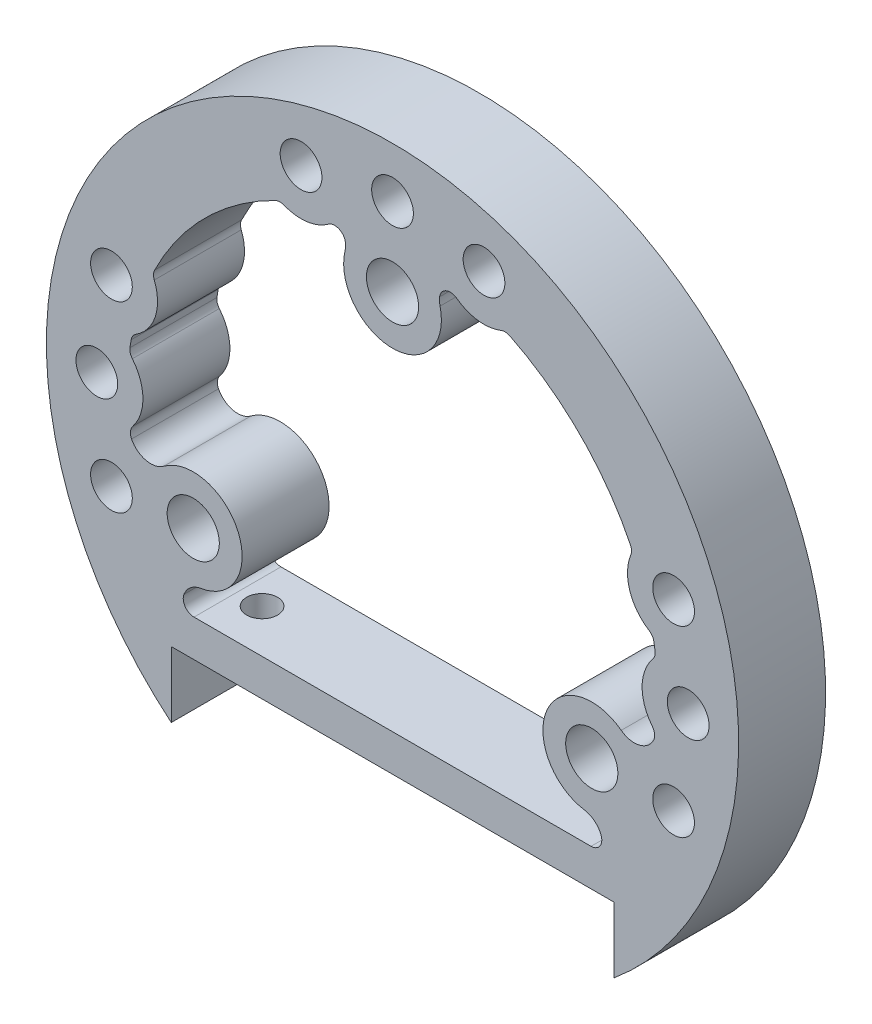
ISO-10303-21;
HEADER;
FILE_DESCRIPTION(('STEP AP214'),'2;1');
FILE_NAME('part.step','',(''),(''),'','','');
FILE_SCHEMA(('AUTOMOTIVE_DESIGN { 1 0 10303 214 1 1 1 1 }'));
ENDSEC;
DATA;
#1=APPLICATION_CONTEXT('core data for automotive mechanical design processes');
#2=APPLICATION_PROTOCOL_DEFINITION('international standard','automotive_design',2000,#1);
#3=PRODUCT_CONTEXT('',#1,'mechanical');
#4=PRODUCT('Part','Part','',(#3));
#5=PRODUCT_RELATED_PRODUCT_CATEGORY('part','',(#4));
#6=PRODUCT_DEFINITION_FORMATION('','',#4);
#7=PRODUCT_DEFINITION_CONTEXT('part definition',#1,'design');
#8=PRODUCT_DEFINITION('design','',#6,#7);
#9=PRODUCT_DEFINITION_SHAPE('','',#8);
#10=(LENGTH_UNIT() NAMED_UNIT(*) SI_UNIT(.MILLI.,.METRE.));
#11=(NAMED_UNIT(*) PLANE_ANGLE_UNIT() SI_UNIT($,.RADIAN.));
#12=(NAMED_UNIT(*) SI_UNIT($,.STERADIAN.) SOLID_ANGLE_UNIT());
#13=UNCERTAINTY_MEASURE_WITH_UNIT(LENGTH_MEASURE(1.E-05),#10,'distance_accuracy_value','');
#14=(GEOMETRIC_REPRESENTATION_CONTEXT(3) GLOBAL_UNCERTAINTY_ASSIGNED_CONTEXT((#13)) GLOBAL_UNIT_ASSIGNED_CONTEXT((#10,
#11,#12)) REPRESENTATION_CONTEXT('',''));
#15=CARTESIAN_POINT('',(0.,0.,0.));
#16=DIRECTION('',(0.,0.,1.));
#17=DIRECTION('',(1.,0.,0.));
#18=AXIS2_PLACEMENT_3D('',#15,#16,#17);
#19=CARTESIAN_POINT('',(0.,0.,0.));
#20=DIRECTION('',(0.,0.,1.));
#21=DIRECTION('',(1.,0.,0.));
#22=AXIS2_PLACEMENT_3D('',#19,#20,#21);
#23=CYLINDRICAL_SURFACE('',#22,19.3675);
#24=CARTESIAN_POINT('',(0.,0.,0.));
#25=DIRECTION('',(0.,0.,1.));
#26=DIRECTION('',(1.,0.,0.));
#27=AXIS2_PLACEMENT_3D('',#24,#25,#26);
#28=CIRCLE('',#27,19.3675);
#29=CARTESIAN_POINT('',(19.1698613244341,2.75979583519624,0.));
#30=VERTEX_POINT('',#29);
#31=CARTESIAN_POINT('',(19.0840145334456,3.30158227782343,0.));
#32=VERTEX_POINT('',#31);
#33=EDGE_CURVE('E325',#30,#32,#28,.T.);
#34=ORIENTED_EDGE('',*,*,#33,.F.);
#35=DIRECTION('',(0.,0.,1.));
#36=VECTOR('',#35,1.);
#37=CARTESIAN_POINT('',(19.1698613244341,2.75979583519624,0.));
#38=LINE('',#37,#36);
#39=CARTESIAN_POINT('',(19.1698613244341,2.75979583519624,6.35));
#40=VERTEX_POINT('',#39);
#41=EDGE_CURVE('E403',#30,#40,#38,.T.);
#42=ORIENTED_EDGE('',*,*,#41,.T.);
#43=CARTESIAN_POINT('',(0.,0.,6.35));
#44=DIRECTION('',(0.,0.,1.));
#45=DIRECTION('',(1.,0.,0.));
#46=AXIS2_PLACEMENT_3D('',#43,#44,#45);
#47=CIRCLE('',#46,19.3675);
#48=CARTESIAN_POINT('',(19.0840145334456,3.30158227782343,6.35));
#49=VERTEX_POINT('',#48);
#50=EDGE_CURVE('E333',#40,#49,#47,.T.);
#51=ORIENTED_EDGE('',*,*,#50,.T.);
#52=DIRECTION('',(0.,0.,1.));
#53=VECTOR('',#52,1.);
#54=CARTESIAN_POINT('',(19.0840145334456,3.30158227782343,0.));
#55=LINE('',#54,#53);
#56=EDGE_CURVE('E400',#49,#32,#55,.F.);
#57=ORIENTED_EDGE('',*,*,#56,.T.);
#58=EDGE_LOOP('',(#34,#42,#51,#57));
#59=FACE_BOUND('',#58,.T.);
#60=ADVANCED_FACE('F34',(#59),#23,.F.);
#61=CARTESIAN_POINT('',(17.3710103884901,8.56434786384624,0.));
#62=VERTEX_POINT('',#61);
#63=CARTESIAN_POINT('',(8.56434786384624,17.3710103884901,0.));
#64=VERTEX_POINT('',#63);
#65=EDGE_CURVE('E668',#62,#64,#28,.T.);
#66=ORIENTED_EDGE('',*,*,#65,.F.);
#67=DIRECTION('',(0.,0.,1.));
#68=VECTOR('',#67,1.);
#69=CARTESIAN_POINT('',(17.3710103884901,8.56434786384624,0.));
#70=LINE('',#69,#68);
#71=CARTESIAN_POINT('',(17.3710103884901,8.56434786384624,6.35));
#72=VERTEX_POINT('',#71);
#73=EDGE_CURVE('E413',#62,#72,#70,.T.);
#74=ORIENTED_EDGE('',*,*,#73,.T.);
#75=CARTESIAN_POINT('',(8.56434786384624,17.3710103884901,6.35));
#76=VERTEX_POINT('',#75);
#77=EDGE_CURVE('E940',#72,#76,#47,.T.);
#78=ORIENTED_EDGE('',*,*,#77,.T.);
#79=DIRECTION('',(0.,0.,1.));
#80=VECTOR('',#79,1.);
#81=CARTESIAN_POINT('',(8.56434786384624,17.3710103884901,0.));
#82=LINE('',#81,#80);
#83=EDGE_CURVE('E410',#76,#64,#82,.F.);
#84=ORIENTED_EDGE('',*,*,#83,.T.);
#85=EDGE_LOOP('',(#66,#74,#78,#84));
#86=FACE_BOUND('',#85,.T.);
#87=ADVANCED_FACE('F640',(#86),#23,.F.);
#88=CARTESIAN_POINT('',(-19.0840145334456,3.30158227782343,6.35));
#89=VERTEX_POINT('',#88);
#90=CARTESIAN_POINT('',(-19.1698613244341,2.75979583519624,6.35));
#91=VERTEX_POINT('',#90);
#92=EDGE_CURVE('E319',#89,#91,#47,.T.);
#93=ORIENTED_EDGE('',*,*,#92,.T.);
#94=DIRECTION('',(0.,0.,1.));
#95=VECTOR('',#94,1.);
#96=CARTESIAN_POINT('',(-19.1698613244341,2.75979583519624,0.));
#97=LINE('',#96,#95);
#98=CARTESIAN_POINT('',(-19.1698613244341,2.75979583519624,0.));
#99=VERTEX_POINT('',#98);
#100=EDGE_CURVE('E446',#91,#99,#97,.F.);
#101=ORIENTED_EDGE('',*,*,#100,.T.);
#102=CARTESIAN_POINT('',(-19.0840145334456,3.30158227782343,0.));
#103=VERTEX_POINT('',#102);
#104=EDGE_CURVE('E320',#103,#99,#28,.T.);
#105=ORIENTED_EDGE('',*,*,#104,.F.);
#106=DIRECTION('',(0.,0.,1.));
#107=VECTOR('',#106,1.);
#108=CARTESIAN_POINT('',(-19.0840145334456,3.30158227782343,0.));
#109=LINE('',#108,#107);
#110=EDGE_CURVE('E443',#103,#89,#109,.T.);
#111=ORIENTED_EDGE('',*,*,#110,.T.);
#112=EDGE_LOOP('',(#93,#101,#105,#111));
#113=FACE_BOUND('',#112,.T.);
#114=ADVANCED_FACE('F647',(#113),#23,.F.);
#115=CARTESIAN_POINT('',(-8.56434786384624,17.3710103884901,0.));
#116=VERTEX_POINT('',#115);
#117=CARTESIAN_POINT('',(-17.3710103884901,8.56434786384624,0.));
#118=VERTEX_POINT('',#117);
#119=EDGE_CURVE('E323',#116,#118,#28,.T.);
#120=ORIENTED_EDGE('',*,*,#119,.F.);
#121=DIRECTION('',(0.,0.,1.));
#122=VECTOR('',#121,1.);
#123=CARTESIAN_POINT('',(-8.56434786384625,17.3710103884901,0.));
#124=LINE('',#123,#122);
#125=CARTESIAN_POINT('',(-8.56434786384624,17.3710103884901,6.35));
#126=VERTEX_POINT('',#125);
#127=EDGE_CURVE('E433',#116,#126,#124,.T.);
#128=ORIENTED_EDGE('',*,*,#127,.T.);
#129=CARTESIAN_POINT('',(-17.3710103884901,8.56434786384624,6.35));
#130=VERTEX_POINT('',#129);
#131=EDGE_CURVE('E332',#126,#130,#47,.T.);
#132=ORIENTED_EDGE('',*,*,#131,.T.);
#133=DIRECTION('',(0.,0.,1.));
#134=VECTOR('',#133,1.);
#135=CARTESIAN_POINT('',(-17.3710103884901,8.56434786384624,0.));
#136=LINE('',#135,#134);
#137=EDGE_CURVE('E430',#130,#118,#136,.F.);
#138=ORIENTED_EDGE('',*,*,#137,.T.);
#139=EDGE_LOOP('',(#120,#128,#132,#138));
#140=FACE_BOUND('',#139,.T.);
#141=ADVANCED_FACE('F643',(#140),#23,.F.);
#142=CARTESIAN_POINT('',(0.,0.,6.35));
#143=DIRECTION('',(0.,0.,-1.));
#144=DIRECTION('',(-1.,0.,0.));
#145=AXIS2_PLACEMENT_3D('',#142,#143,#144);
#146=CYLINDRICAL_SURFACE('',#145,25.273);
#147=CARTESIAN_POINT('',(0.,0.,0.));
#148=DIRECTION('',(0.,0.,1.));
#149=DIRECTION('',(1.,0.,0.));
#150=AXIS2_PLACEMENT_3D('',#147,#148,#149);
#151=CIRCLE('',#150,25.273);
#152=CARTESIAN_POINT('',(16.1544,-19.4360461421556,0.));
#153=VERTEX_POINT('',#152);
#154=CARTESIAN_POINT('',(-16.1544,-19.4360461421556,0.));
#155=VERTEX_POINT('',#154);
#156=EDGE_CURVE('E329',#153,#155,#151,.T.);
#157=ORIENTED_EDGE('',*,*,#156,.T.);
#158=DIRECTION('',(0.,0.,-1.));
#159=VECTOR('',#158,1.);
#160=CARTESIAN_POINT('',(-16.1544,-19.4360461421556,6.35));
#161=LINE('',#160,#159);
#162=CARTESIAN_POINT('',(-16.1544,-19.4360461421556,6.35));
#163=VERTEX_POINT('',#162);
#164=EDGE_CURVE('E298',#155,#163,#161,.F.);
#165=ORIENTED_EDGE('',*,*,#164,.T.);
#166=CARTESIAN_POINT('',(0.,0.,6.35));
#167=DIRECTION('',(0.,0.,1.));
#168=DIRECTION('',(1.,0.,0.));
#169=AXIS2_PLACEMENT_3D('',#166,#167,#168);
#170=CIRCLE('',#169,25.273);
#171=CARTESIAN_POINT('',(16.1544,-19.4360461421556,6.35));
#172=VERTEX_POINT('',#171);
#173=EDGE_CURVE('E336',#172,#163,#170,.T.);
#174=ORIENTED_EDGE('',*,*,#173,.F.);
#175=DIRECTION('',(0.,0.,-1.));
#176=VECTOR('',#175,1.);
#177=CARTESIAN_POINT('',(16.1544,-19.4360461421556,6.35));
#178=LINE('',#177,#176);
#179=EDGE_CURVE('E291',#172,#153,#178,.T.);
#180=ORIENTED_EDGE('',*,*,#179,.T.);
#181=EDGE_LOOP('',(#157,#165,#174,#180));
#182=FACE_BOUND('',#181,.T.);
#183=ADVANCED_FACE('F653',(#182),#146,.T.);
#184=CARTESIAN_POINT('',(0.,0.,6.35));
#185=DIRECTION('',(0.,0.,1.));
#186=DIRECTION('',(1.,0.,0.));
#187=AXIS2_PLACEMENT_3D('',#184,#185,#186);
#188=PLANE('',#187);
#189=ORIENTED_EDGE('',*,*,#50,.F.);
#190=CARTESIAN_POINT('',(18.3904964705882,2.64759429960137,6.35));
#191=DIRECTION('',(0.,0.,1.));
#192=DIRECTION('',(1.,0.,0.));
#193=AXIS2_PLACEMENT_3D('',#190,#191,#192);
#194=CIRCLE('',#193,0.7874);
#195=CARTESIAN_POINT('',(18.9971301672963,2.14560394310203,6.35));
#196=VERTEX_POINT('',#195);
#197=EDGE_CURVE('E464',#40,#196,#194,.F.);
#198=ORIENTED_EDGE('',*,*,#197,.T.);
#199=CARTESIAN_POINT('',(21.59,0.,6.35));
#200=DIRECTION('',(0.,0.,1.));
#201=DIRECTION('',(1.,0.,0.));
#202=AXIS2_PLACEMENT_3D('',#199,#200,#201);
#203=CIRCLE('',#202,3.3655);
#204=CARTESIAN_POINT('',(18.9667222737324,-2.10831786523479,6.35));
#205=VERTEX_POINT('',#204);
#206=EDGE_CURVE('E920',#196,#205,#203,.T.);
#207=ORIENTED_EDGE('',*,*,#206,.T.);
#208=CARTESIAN_POINT('',(18.3529742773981,-2.601584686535,6.35));
#209=DIRECTION('',(0.,0.,1.));
#210=DIRECTION('',(1.,0.,0.));
#211=AXIS2_PLACEMENT_3D('',#208,#209,#210);
#212=CIRCLE('',#211,0.7874);
#213=CARTESIAN_POINT('',(19.0555975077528,-2.95699903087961,6.35));
#214=VERTEX_POINT('',#213);
#215=EDGE_CURVE('E462',#205,#214,#212,.F.);
#216=ORIENTED_EDGE('',*,*,#215,.T.);
#217=CARTESIAN_POINT('',(17.6503510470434,-2.24617034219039,6.35));
#218=DIRECTION('',(0.,0.,1.));
#219=DIRECTION('',(1.,0.,0.));
#220=AXIS2_PLACEMENT_3D('',#217,#218,#219);
#221=CIRCLE('',#220,1.5748);
#222=CARTESIAN_POINT('',(16.7010091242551,-3.5026515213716,6.35));
#223=VERTEX_POINT('',#222);
#224=EDGE_CURVE('E353',#214,#223,#221,.F.);
#225=ORIENTED_EDGE('',*,*,#224,.T.);
#226=CARTESIAN_POINT('',(14.5496778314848,-6.35,6.35));
#227=DIRECTION('',(0.,0.,1.));
#228=DIRECTION('',(1.,0.,0.));
#229=AXIS2_PLACEMENT_3D('',#226,#227,#228);
#230=CIRCLE('',#229,3.5687);
#231=CARTESIAN_POINT('',(14.0012779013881,-9.87631212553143,6.35));
#232=VERTEX_POINT('',#231);
#233=EDGE_CURVE('E705',#223,#232,#230,.T.);
#234=ORIENTED_EDGE('',*,*,#233,.T.);
#235=CARTESIAN_POINT('',(13.7592793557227,-11.432407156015,6.35));
#236=DIRECTION('',(0.,0.,1.));
#237=DIRECTION('',(1.,0.,0.));
#238=AXIS2_PLACEMENT_3D('',#235,#236,#237);
#239=CIRCLE('',#238,1.5748);
#240=CARTESIAN_POINT('',(15.2297670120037,-10.868792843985,6.35));
#241=VERTEX_POINT('',#240);
#242=EDGE_CURVE('E360',#232,#241,#239,.F.);
#243=ORIENTED_EDGE('',*,*,#242,.T.);
#244=CARTESIAN_POINT('',(14.4945231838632,-11.1506,6.35));
#245=DIRECTION('',(0.,0.,1.));
#246=DIRECTION('',(1.,0.,0.));
#247=AXIS2_PLACEMENT_3D('',#244,#245,#246);
#248=CIRCLE('',#247,0.7874);
#249=CARTESIAN_POINT('',(14.4945231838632,-11.938,6.35));
#250=VERTEX_POINT('',#249);
#251=EDGE_CURVE('E452',#241,#250,#248,.F.);
#252=ORIENTED_EDGE('',*,*,#251,.T.);
#253=DIRECTION('',(1.,0.,0.));
#254=VECTOR('',#253,1.);
#255=CARTESIAN_POINT('',(-15.2507118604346,-11.938,6.35));
#256=LINE('',#255,#254);
#257=CARTESIAN_POINT('',(-14.4945231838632,-11.938,6.35));
#258=VERTEX_POINT('',#257);
#259=EDGE_CURVE('E324',#258,#250,#256,.T.);
#260=ORIENTED_EDGE('',*,*,#259,.F.);
#261=CARTESIAN_POINT('',(-14.4945231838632,-11.1506,6.35));
#262=DIRECTION('',(0.,0.,1.));
#263=DIRECTION('',(1.,0.,0.));
#264=AXIS2_PLACEMENT_3D('',#261,#262,#263);
#265=CIRCLE('',#264,0.7874);
#266=CARTESIAN_POINT('',(-15.2297670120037,-10.868792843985,6.35));
#267=VERTEX_POINT('',#266);
#268=EDGE_CURVE('E456',#258,#267,#265,.F.);
#269=ORIENTED_EDGE('',*,*,#268,.T.);
#270=CARTESIAN_POINT('',(-13.7592793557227,-11.432407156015,6.35));
#271=DIRECTION('',(0.,0.,1.));
#272=DIRECTION('',(1.,0.,0.));
#273=AXIS2_PLACEMENT_3D('',#270,#271,#272);
#274=CIRCLE('',#273,1.5748);
#275=CARTESIAN_POINT('',(-14.0012779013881,-9.87631212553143,6.35));
#276=VERTEX_POINT('',#275);
#277=EDGE_CURVE('E363',#267,#276,#274,.F.);
#278=ORIENTED_EDGE('',*,*,#277,.T.);
#279=CARTESIAN_POINT('',(-14.5496778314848,-6.35,6.35));
#280=DIRECTION('',(0.,0.,1.));
#281=DIRECTION('',(1.,0.,0.));
#282=AXIS2_PLACEMENT_3D('',#279,#280,#281);
#283=CIRCLE('',#282,3.5687);
#284=CARTESIAN_POINT('',(-16.7010091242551,-3.5026515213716,6.35));
#285=VERTEX_POINT('',#284);
#286=EDGE_CURVE('E719',#276,#285,#283,.T.);
#287=ORIENTED_EDGE('',*,*,#286,.T.);
#288=CARTESIAN_POINT('',(-17.6503510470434,-2.24617034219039,6.35));
#289=DIRECTION('',(0.,0.,1.));
#290=DIRECTION('',(1.,0.,0.));
#291=AXIS2_PLACEMENT_3D('',#288,#289,#290);
#292=CIRCLE('',#291,1.5748);
#293=CARTESIAN_POINT('',(-19.0555975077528,-2.95699903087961,6.35));
#294=VERTEX_POINT('',#293);
#295=EDGE_CURVE('E370',#285,#294,#292,.F.);
#296=ORIENTED_EDGE('',*,*,#295,.T.);
#297=CARTESIAN_POINT('',(-18.3529742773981,-2.601584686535,6.35));
#298=DIRECTION('',(0.,0.,1.));
#299=DIRECTION('',(1.,0.,0.));
#300=AXIS2_PLACEMENT_3D('',#297,#298,#299);
#301=CIRCLE('',#300,0.7874);
#302=CARTESIAN_POINT('',(-18.9667222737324,-2.10831786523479,6.35));
#303=VERTEX_POINT('',#302);
#304=EDGE_CURVE('E492',#294,#303,#301,.F.);
#305=ORIENTED_EDGE('',*,*,#304,.T.);
#306=CARTESIAN_POINT('',(-21.59,0.,6.35));
#307=DIRECTION('',(0.,0.,1.));
#308=DIRECTION('',(1.,0.,0.));
#309=AXIS2_PLACEMENT_3D('',#306,#307,#308);
#310=CIRCLE('',#309,3.3655);
#311=CARTESIAN_POINT('',(-18.9971301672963,2.14560394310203,6.35));
#312=VERTEX_POINT('',#311);
#313=EDGE_CURVE('E687',#303,#312,#310,.T.);
#314=ORIENTED_EDGE('',*,*,#313,.T.);
#315=CARTESIAN_POINT('',(-18.3904964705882,2.64759429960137,6.35));
#316=DIRECTION('',(0.,0.,1.));
#317=DIRECTION('',(1.,0.,0.));
#318=AXIS2_PLACEMENT_3D('',#315,#316,#317);
#319=CIRCLE('',#318,0.7874);
#320=EDGE_CURVE('E498',#312,#91,#319,.F.);
#321=ORIENTED_EDGE('',*,*,#320,.T.);
#322=ORIENTED_EDGE('',*,*,#92,.F.);
#323=CARTESIAN_POINT('',(-18.308139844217,3.16735401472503,6.35));
#324=DIRECTION('',(0.,0.,1.));
#325=DIRECTION('',(1.,0.,0.));
#326=AXIS2_PLACEMENT_3D('',#323,#324,#325);
#327=CIRCLE('',#326,0.7874);
#328=CARTESIAN_POINT('',(-18.7281206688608,3.83339820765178,6.35));
#329=VERTEX_POINT('',#328);
#330=EDGE_CURVE('E57',#89,#329,#327,.F.);
#331=ORIENTED_EDGE('',*,*,#330,.T.);
#332=CARTESIAN_POINT('',(-20.5232,6.6802,6.35));
#333=DIRECTION('',(0.,0.,1.));
#334=DIRECTION('',(1.,0.,0.));
#335=AXIS2_PLACEMENT_3D('',#332,#333,#334);
#336=CIRCLE('',#335,3.3655);
#337=CARTESIAN_POINT('',(-17.396345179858,7.92493659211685,6.35));
#338=VERTEX_POINT('',#337);
#339=EDGE_CURVE('E697',#329,#338,#336,.T.);
#340=ORIENTED_EDGE('',*,*,#339,.T.);
#341=CARTESIAN_POINT('',(-16.6647791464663,8.21615798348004,6.35));
#342=DIRECTION('',(0.,0.,1.));
#343=DIRECTION('',(1.,0.,0.));
#344=AXIS2_PLACEMENT_3D('',#341,#342,#343);
#345=CIRCLE('',#344,0.7874);
#346=EDGE_CURVE('E505',#338,#130,#345,.F.);
#347=ORIENTED_EDGE('',*,*,#346,.T.);
#348=ORIENTED_EDGE('',*,*,#131,.F.);
#349=CARTESIAN_POINT('',(-8.21615798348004,16.6647791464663,6.35));
#350=DIRECTION('',(0.,0.,1.));
#351=DIRECTION('',(1.,0.,0.));
#352=AXIS2_PLACEMENT_3D('',#349,#350,#351);
#353=CIRCLE('',#352,0.7874);
#354=CARTESIAN_POINT('',(-7.92493659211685,17.396345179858,6.35));
#355=VERTEX_POINT('',#354);
#356=EDGE_CURVE('E488',#126,#355,#353,.F.);
#357=ORIENTED_EDGE('',*,*,#356,.T.);
#358=CARTESIAN_POINT('',(-6.6802,20.5232,6.35));
#359=DIRECTION('',(0.,0.,1.));
#360=DIRECTION('',(1.,0.,0.));
#361=AXIS2_PLACEMENT_3D('',#358,#359,#360);
#362=CIRCLE('',#361,3.3655);
#363=CARTESIAN_POINT('',(-4.68701355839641,17.8114112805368,6.35));
#364=VERTEX_POINT('',#363);
#365=EDGE_CURVE('E677',#355,#364,#362,.T.);
#366=ORIENTED_EDGE('',*,*,#365,.T.);
#367=CARTESIAN_POINT('',(-4.22068314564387,17.1769550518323,6.35));
#368=DIRECTION('',(0.,0.,1.));
#369=DIRECTION('',(1.,0.,0.));
#370=AXIS2_PLACEMENT_3D('',#367,#368,#369);
#371=CIRCLE('',#370,0.7874);
#372=CARTESIAN_POINT('',(-3.43987499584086,17.2786280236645,6.35));
#373=VERTEX_POINT('',#372);
#374=EDGE_CURVE('E486',#364,#373,#371,.F.);
#375=ORIENTED_EDGE('',*,*,#374,.T.);
#376=CARTESIAN_POINT('',(-5.00149129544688,17.07528208,6.35));
#377=DIRECTION('',(0.,0.,1.));
#378=DIRECTION('',(1.,0.,0.));
#379=AXIS2_PLACEMENT_3D('',#376,#377,#378);
#380=CIRCLE('',#379,1.5748);
#381=CARTESIAN_POINT('',(-3.4701705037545,16.707788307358,6.35));
#382=VERTEX_POINT('',#381);
#383=EDGE_CURVE('E373',#373,#382,#380,.F.);
#384=ORIENTED_EDGE('',*,*,#383,.T.);
#385=CARTESIAN_POINT('',(0.,15.875,6.35));
#386=DIRECTION('',(0.,0.,1.));
#387=DIRECTION('',(1.,0.,0.));
#388=AXIS2_PLACEMENT_3D('',#385,#386,#387);
#389=CIRCLE('',#388,3.5687);
#390=CARTESIAN_POINT('',(3.4701705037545,16.707788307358,6.35));
#391=VERTEX_POINT('',#390);
#392=EDGE_CURVE('E725',#382,#391,#389,.T.);
#393=ORIENTED_EDGE('',*,*,#392,.T.);
#394=CARTESIAN_POINT('',(5.00149129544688,17.07528208,6.35));
#395=DIRECTION('',(0.,0.,1.));
#396=DIRECTION('',(1.,0.,0.));
#397=AXIS2_PLACEMENT_3D('',#394,#395,#396);
#398=CIRCLE('',#397,1.5748);
#399=CARTESIAN_POINT('',(3.43987499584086,17.2786280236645,6.35));
#400=VERTEX_POINT('',#399);
#401=EDGE_CURVE('E380',#391,#400,#398,.F.);
#402=ORIENTED_EDGE('',*,*,#401,.T.);
#403=CARTESIAN_POINT('',(4.22068314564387,17.1769550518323,6.35));
#404=DIRECTION('',(0.,0.,1.));
#405=DIRECTION('',(1.,0.,0.));
#406=AXIS2_PLACEMENT_3D('',#403,#404,#405);
#407=CIRCLE('',#406,0.7874);
#408=CARTESIAN_POINT('',(4.68701355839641,17.8114112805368,6.35));
#409=VERTEX_POINT('',#408);
#410=EDGE_CURVE('E480',#400,#409,#407,.F.);
#411=ORIENTED_EDGE('',*,*,#410,.T.);
#412=CARTESIAN_POINT('',(6.6802,20.5232,6.35));
#413=DIRECTION('',(0.,0.,1.));
#414=DIRECTION('',(1.,0.,0.));
#415=AXIS2_PLACEMENT_3D('',#412,#413,#414);
#416=CIRCLE('',#415,3.3655);
#417=CARTESIAN_POINT('',(7.92493659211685,17.396345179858,6.35));
#418=VERTEX_POINT('',#417);
#419=EDGE_CURVE('E690',#409,#418,#416,.T.);
#420=ORIENTED_EDGE('',*,*,#419,.T.);
#421=CARTESIAN_POINT('',(8.21615798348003,16.6647791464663,6.35));
#422=DIRECTION('',(0.,0.,1.));
#423=DIRECTION('',(1.,0.,0.));
#424=AXIS2_PLACEMENT_3D('',#421,#422,#423);
#425=CIRCLE('',#424,0.7874);
#426=EDGE_CURVE('E478',#418,#76,#425,.F.);
#427=ORIENTED_EDGE('',*,*,#426,.T.);
#428=ORIENTED_EDGE('',*,*,#77,.F.);
#429=CARTESIAN_POINT('',(16.6647791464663,8.21615798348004,6.35));
#430=DIRECTION('',(0.,0.,1.));
#431=DIRECTION('',(1.,0.,0.));
#432=AXIS2_PLACEMENT_3D('',#429,#430,#431);
#433=CIRCLE('',#432,0.7874);
#434=CARTESIAN_POINT('',(17.396345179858,7.92493659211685,6.35));
#435=VERTEX_POINT('',#434);
#436=EDGE_CURVE('E472',#72,#435,#433,.F.);
#437=ORIENTED_EDGE('',*,*,#436,.T.);
#438=CARTESIAN_POINT('',(20.5232,6.6802,6.35));
#439=DIRECTION('',(0.,0.,1.));
#440=DIRECTION('',(1.,0.,0.));
#441=AXIS2_PLACEMENT_3D('',#438,#439,#440);
#442=CIRCLE('',#441,3.3655);
#443=CARTESIAN_POINT('',(18.7281206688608,3.83339820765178,6.35));
#444=VERTEX_POINT('',#443);
#445=EDGE_CURVE('E919',#435,#444,#442,.T.);
#446=ORIENTED_EDGE('',*,*,#445,.T.);
#447=CARTESIAN_POINT('',(18.308139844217,3.16735401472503,6.35));
#448=DIRECTION('',(0.,0.,1.));
#449=DIRECTION('',(1.,0.,0.));
#450=AXIS2_PLACEMENT_3D('',#447,#448,#449);
#451=CIRCLE('',#450,0.7874);
#452=EDGE_CURVE('E470',#444,#49,#451,.F.);
#453=ORIENTED_EDGE('',*,*,#452,.T.);
#454=EDGE_LOOP('',(#189,#198,#207,#216,#225,#234,#243,#252,#260,#269,#278,#287,#296,#305,#314,
#321,#322,#331,#340,#347,#348,#357,#366,#375,#384,#393,#402,#411,#420,#427,#428,#437,#446,#453));
#455=FACE_BOUND('',#454,.T.);
#456=CARTESIAN_POINT('',(0.,15.875,6.35));
#457=DIRECTION('',(0.,0.,1.));
#458=DIRECTION('',(1.,0.,0.));
#459=AXIS2_PLACEMENT_3D('',#456,#457,#458);
#460=CIRCLE('',#459,1.905);
#461=CARTESIAN_POINT('',(1.905,15.875,6.35));
#462=VERTEX_POINT('',#461);
#463=EDGE_CURVE('E706',#462,#462,#460,.T.);
#464=ORIENTED_EDGE('',*,*,#463,.F.);
#465=EDGE_LOOP('',(#464));
#466=FACE_BOUND('',#465,.T.);
#467=CARTESIAN_POINT('',(-14.5496778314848,-6.35,6.35));
#468=DIRECTION('',(0.,0.,1.));
#469=DIRECTION('',(1.,0.,0.));
#470=AXIS2_PLACEMENT_3D('',#467,#468,#469);
#471=CIRCLE('',#470,1.905);
#472=CARTESIAN_POINT('',(-12.6446778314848,-6.35,6.35));
#473=VERTEX_POINT('',#472);
#474=EDGE_CURVE('E710',#473,#473,#471,.T.);
#475=ORIENTED_EDGE('',*,*,#474,.F.);
#476=EDGE_LOOP('',(#475));
#477=FACE_BOUND('',#476,.T.);
#478=CARTESIAN_POINT('',(14.5496778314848,-6.35,6.35));
#479=DIRECTION('',(0.,0.,1.));
#480=DIRECTION('',(1.,0.,0.));
#481=AXIS2_PLACEMENT_3D('',#478,#479,#480);
#482=CIRCLE('',#481,1.905);
#483=CARTESIAN_POINT('',(16.4546778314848,-6.35,6.35));
#484=VERTEX_POINT('',#483);
#485=EDGE_CURVE('E702',#484,#484,#482,.T.);
#486=ORIENTED_EDGE('',*,*,#485,.F.);
#487=EDGE_LOOP('',(#486));
#488=FACE_BOUND('',#487,.T.);
#489=CARTESIAN_POINT('',(0.,21.59,6.35));
#490=DIRECTION('',(0.,0.,1.));
#491=DIRECTION('',(1.,0.,0.));
#492=AXIS2_PLACEMENT_3D('',#489,#490,#491);
#493=CIRCLE('',#492,1.524);
#494=CARTESIAN_POINT('',(1.524,21.59,6.35));
#495=VERTEX_POINT('',#494);
#496=EDGE_CURVE('E598',#495,#495,#493,.T.);
#497=ORIENTED_EDGE('',*,*,#496,.F.);
#498=EDGE_LOOP('',(#497));
#499=FACE_BOUND('',#498,.T.);
#500=CARTESIAN_POINT('',(20.5232,-6.6802,6.35));
#501=DIRECTION('',(0.,0.,1.));
#502=DIRECTION('',(1.,0.,0.));
#503=AXIS2_PLACEMENT_3D('',#500,#501,#502);
#504=CIRCLE('',#503,1.524);
#505=CARTESIAN_POINT('',(22.0472,-6.6802,6.35));
#506=VERTEX_POINT('',#505);
#507=EDGE_CURVE('E583',#506,#506,#504,.T.);
#508=ORIENTED_EDGE('',*,*,#507,.F.);
#509=EDGE_LOOP('',(#508));
#510=FACE_BOUND('',#509,.T.);
#511=CARTESIAN_POINT('',(-20.5232,-6.6802,6.35));
#512=DIRECTION('',(0.,0.,1.));
#513=DIRECTION('',(1.,0.,0.));
#514=AXIS2_PLACEMENT_3D('',#511,#512,#513);
#515=CIRCLE('',#514,1.524);
#516=CARTESIAN_POINT('',(-18.9992,-6.6802,6.35));
#517=VERTEX_POINT('',#516);
#518=EDGE_CURVE('E584',#517,#517,#515,.T.);
#519=ORIENTED_EDGE('',*,*,#518,.F.);
#520=EDGE_LOOP('',(#519));
#521=FACE_BOUND('',#520,.T.);
#522=DIRECTION('',(0.,-1.,0.));
#523=VECTOR('',#522,1.);
#524=CARTESIAN_POINT('',(-16.1544,-33.6804,6.35));
#525=LINE('',#524,#523);
#526=CARTESIAN_POINT('',(-16.1544,-14.6304,6.35));
#527=VERTEX_POINT('',#526);
#528=EDGE_CURVE('E310',#527,#163,#525,.T.);
#529=ORIENTED_EDGE('',*,*,#528,.F.);
#530=DIRECTION('',(-1.,0.,0.));
#531=VECTOR('',#530,1.);
#532=CARTESIAN_POINT('',(-16.1544,-14.6304,6.35));
#533=LINE('',#532,#531);
#534=CARTESIAN_POINT('',(16.1544,-14.6304,6.35));
#535=VERTEX_POINT('',#534);
#536=EDGE_CURVE('E288',#535,#527,#533,.T.);
#537=ORIENTED_EDGE('',*,*,#536,.F.);
#538=DIRECTION('',(0.,1.,0.));
#539=VECTOR('',#538,1.);
#540=CARTESIAN_POINT('',(16.1544,-33.6804,6.35));
#541=LINE('',#540,#539);
#542=EDGE_CURVE('E312',#172,#535,#541,.T.);
#543=ORIENTED_EDGE('',*,*,#542,.F.);
#544=ORIENTED_EDGE('',*,*,#173,.T.);
#545=EDGE_LOOP('',(#529,#537,#543,#544));
#546=FACE_BOUND('',#545,.T.);
#547=CARTESIAN_POINT('',(-20.5232,6.6802,6.35));
#548=DIRECTION('',(0.,0.,1.));
#549=DIRECTION('',(1.,0.,0.));
#550=AXIS2_PLACEMENT_3D('',#547,#548,#549);
#551=CIRCLE('',#550,1.524);
#552=CARTESIAN_POINT('',(-18.9992,6.6802,6.35));
#553=VERTEX_POINT('',#552);
#554=EDGE_CURVE('E601',#553,#553,#551,.T.);
#555=ORIENTED_EDGE('',*,*,#554,.F.);
#556=EDGE_LOOP('',(#555));
#557=FACE_BOUND('',#556,.T.);
#558=CARTESIAN_POINT('',(-21.59,0.,6.35));
#559=DIRECTION('',(0.,0.,1.));
#560=DIRECTION('',(1.,0.,0.));
#561=AXIS2_PLACEMENT_3D('',#558,#559,#560);
#562=CIRCLE('',#561,1.524);
#563=CARTESIAN_POINT('',(-20.066,0.,6.35));
#564=VERTEX_POINT('',#563);
#565=EDGE_CURVE('E596',#564,#564,#562,.T.);
#566=ORIENTED_EDGE('',*,*,#565,.F.);
#567=EDGE_LOOP('',(#566));
#568=FACE_BOUND('',#567,.T.);
#569=CARTESIAN_POINT('',(-6.6802,20.5232,6.35));
#570=DIRECTION('',(0.,0.,1.));
#571=DIRECTION('',(1.,0.,0.));
#572=AXIS2_PLACEMENT_3D('',#569,#570,#571);
#573=CIRCLE('',#572,1.524);
#574=CARTESIAN_POINT('',(-5.1562,20.5232,6.35));
#575=VERTEX_POINT('',#574);
#576=EDGE_CURVE('E605',#575,#575,#573,.T.);
#577=ORIENTED_EDGE('',*,*,#576,.F.);
#578=EDGE_LOOP('',(#577));
#579=FACE_BOUND('',#578,.T.);
#580=CARTESIAN_POINT('',(6.6802,20.5232,6.35));
#581=DIRECTION('',(0.,0.,1.));
#582=DIRECTION('',(1.,0.,0.));
#583=AXIS2_PLACEMENT_3D('',#580,#581,#582);
#584=CIRCLE('',#583,1.524);
#585=CARTESIAN_POINT('',(8.2042,20.5232,6.35));
#586=VERTEX_POINT('',#585);
#587=EDGE_CURVE('E602',#586,#586,#584,.T.);
#588=ORIENTED_EDGE('',*,*,#587,.F.);
#589=EDGE_LOOP('',(#588));
#590=FACE_BOUND('',#589,.T.);
#591=CARTESIAN_POINT('',(20.5232,6.6802,6.35));
#592=DIRECTION('',(0.,0.,1.));
#593=DIRECTION('',(1.,0.,0.));
#594=AXIS2_PLACEMENT_3D('',#591,#592,#593);
#595=CIRCLE('',#594,1.524);
#596=CARTESIAN_POINT('',(22.0472,6.6802,6.35));
#597=VERTEX_POINT('',#596);
#598=EDGE_CURVE('E734',#597,#597,#595,.T.);
#599=ORIENTED_EDGE('',*,*,#598,.F.);
#600=EDGE_LOOP('',(#599));
#601=FACE_BOUND('',#600,.T.);
#602=CARTESIAN_POINT('',(21.59,0.,6.35));
#603=DIRECTION('',(0.,0.,1.));
#604=DIRECTION('',(1.,0.,0.));
#605=AXIS2_PLACEMENT_3D('',#602,#603,#604);
#606=CIRCLE('',#605,1.524);
#607=CARTESIAN_POINT('',(23.114,0.,6.35));
#608=VERTEX_POINT('',#607);
#609=EDGE_CURVE('E593',#608,#608,#606,.T.);
#610=ORIENTED_EDGE('',*,*,#609,.F.);
#611=EDGE_LOOP('',(#610));
#612=FACE_BOUND('',#611,.T.);
#613=ADVANCED_FACE('F551',(#455,#466,#477,#488,#499,#510,#521,#546,#557,#568,#579,#590,#601,
#612),#188,.T.);
#614=CARTESIAN_POINT('',(0.,0.,0.));
#615=DIRECTION('',(0.,0.,1.));
#616=DIRECTION('',(1.,0.,0.));
#617=AXIS2_PLACEMENT_3D('',#614,#615,#616);
#618=PLANE('',#617);
#619=CARTESIAN_POINT('',(6.6802,20.5232,0.));
#620=DIRECTION('',(0.,0.,1.));
#621=DIRECTION('',(1.,0.,0.));
#622=AXIS2_PLACEMENT_3D('',#619,#620,#621);
#623=CIRCLE('',#622,3.06959181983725);
#624=CARTESIAN_POINT('',(9.74979181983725,20.5232,0.));
#625=VERTEX_POINT('',#624);
#626=EDGE_CURVE('E522',#625,#625,#623,.T.);
#627=ORIENTED_EDGE('',*,*,#626,.T.);
#628=EDGE_LOOP('',(#627));
#629=FACE_BOUND('',#628,.T.);
#630=CARTESIAN_POINT('',(-21.59,0.,0.));
#631=DIRECTION('',(0.,0.,1.));
#632=DIRECTION('',(1.,0.,0.));
#633=AXIS2_PLACEMENT_3D('',#630,#631,#632);
#634=CIRCLE('',#633,3.06959181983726);
#635=CARTESIAN_POINT('',(-18.5204081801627,0.,0.));
#636=VERTEX_POINT('',#635);
#637=EDGE_CURVE('E519',#636,#636,#634,.T.);
#638=ORIENTED_EDGE('',*,*,#637,.T.);
#639=EDGE_LOOP('',(#638));
#640=FACE_BOUND('',#639,.T.);
#641=CARTESIAN_POINT('',(20.5232,6.6802,0.));
#642=DIRECTION('',(0.,0.,1.));
#643=DIRECTION('',(1.,0.,0.));
#644=AXIS2_PLACEMENT_3D('',#641,#642,#643);
#645=CIRCLE('',#644,3.06959181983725);
#646=CARTESIAN_POINT('',(23.5927918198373,6.6802,0.));
#647=VERTEX_POINT('',#646);
#648=EDGE_CURVE('E516',#647,#647,#645,.T.);
#649=ORIENTED_EDGE('',*,*,#648,.T.);
#650=EDGE_LOOP('',(#649));
#651=FACE_BOUND('',#650,.T.);
#652=CARTESIAN_POINT('',(21.59,0.,0.));
#653=DIRECTION('',(0.,0.,1.));
#654=DIRECTION('',(1.,0.,0.));
#655=AXIS2_PLACEMENT_3D('',#652,#653,#654);
#656=CIRCLE('',#655,3.06959181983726);
#657=CARTESIAN_POINT('',(24.6595918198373,0.,0.));
#658=VERTEX_POINT('',#657);
#659=EDGE_CURVE('E513',#658,#658,#656,.T.);
#660=ORIENTED_EDGE('',*,*,#659,.T.);
#661=EDGE_LOOP('',(#660));
#662=FACE_BOUND('',#661,.T.);
#663=CARTESIAN_POINT('',(-20.5232,6.6802,0.));
#664=DIRECTION('',(0.,0.,1.));
#665=DIRECTION('',(1.,0.,0.));
#666=AXIS2_PLACEMENT_3D('',#663,#664,#665);
#667=CIRCLE('',#666,3.06959181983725);
#668=CARTESIAN_POINT('',(-17.4536081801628,6.6802,0.));
#669=VERTEX_POINT('',#668);
#670=EDGE_CURVE('E510',#669,#669,#667,.T.);
#671=ORIENTED_EDGE('',*,*,#670,.T.);
#672=EDGE_LOOP('',(#671));
#673=FACE_BOUND('',#672,.T.);
#674=CARTESIAN_POINT('',(-6.6802,20.5232,0.));
#675=DIRECTION('',(0.,0.,1.));
#676=DIRECTION('',(1.,0.,0.));
#677=AXIS2_PLACEMENT_3D('',#674,#675,#676);
#678=CIRCLE('',#677,3.06959181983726);
#679=CARTESIAN_POINT('',(-9.74979181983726,20.5232,0.));
#680=VERTEX_POINT('',#679);
#681=EDGE_CURVE('E507',#680,#680,#678,.T.);
#682=ORIENTED_EDGE('',*,*,#681,.T.);
#683=EDGE_LOOP('',(#682));
#684=FACE_BOUND('',#683,.T.);
#685=CARTESIAN_POINT('',(17.6503510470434,-2.24617034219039,0.));
#686=DIRECTION('',(0.,0.,1.));
#687=DIRECTION('',(1.,0.,0.));
#688=AXIS2_PLACEMENT_3D('',#685,#686,#687);
#689=CIRCLE('',#688,1.5748);
#690=CARTESIAN_POINT('',(16.7010091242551,-3.5026515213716,0.));
#691=VERTEX_POINT('',#690);
#692=CARTESIAN_POINT('',(19.0555975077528,-2.95699903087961,0.));
#693=VERTEX_POINT('',#692);
#694=EDGE_CURVE('E355',#691,#693,#689,.T.);
#695=ORIENTED_EDGE('',*,*,#694,.T.);
#696=CARTESIAN_POINT('',(18.3529742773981,-2.601584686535,0.));
#697=DIRECTION('',(0.,0.,1.));
#698=DIRECTION('',(1.,0.,0.));
#699=AXIS2_PLACEMENT_3D('',#696,#697,#698);
#700=CIRCLE('',#699,0.7874);
#701=CARTESIAN_POINT('',(18.9667222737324,-2.10831786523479,0.));
#702=VERTEX_POINT('',#701);
#703=EDGE_CURVE('E460',#693,#702,#700,.T.);
#704=ORIENTED_EDGE('',*,*,#703,.T.);
#705=CARTESIAN_POINT('',(21.59,0.,0.));
#706=DIRECTION('',(0.,0.,1.));
#707=DIRECTION('',(1.,0.,0.));
#708=AXIS2_PLACEMENT_3D('',#705,#706,#707);
#709=CIRCLE('',#708,3.3655);
#710=CARTESIAN_POINT('',(18.9971301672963,2.14560394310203,0.));
#711=VERTEX_POINT('',#710);
#712=EDGE_CURVE('E913',#711,#702,#709,.T.);
#713=ORIENTED_EDGE('',*,*,#712,.F.);
#714=CARTESIAN_POINT('',(18.3904964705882,2.64759429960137,0.));
#715=DIRECTION('',(0.,0.,1.));
#716=DIRECTION('',(1.,0.,0.));
#717=AXIS2_PLACEMENT_3D('',#714,#715,#716);
#718=CIRCLE('',#717,0.7874);
#719=EDGE_CURVE('E466',#711,#30,#718,.T.);
#720=ORIENTED_EDGE('',*,*,#719,.T.);
#721=ORIENTED_EDGE('',*,*,#33,.T.);
#722=CARTESIAN_POINT('',(18.308139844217,3.16735401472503,0.));
#723=DIRECTION('',(0.,0.,1.));
#724=DIRECTION('',(1.,0.,0.));
#725=AXIS2_PLACEMENT_3D('',#722,#723,#724);
#726=CIRCLE('',#725,0.7874);
#727=CARTESIAN_POINT('',(18.7281206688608,3.83339820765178,0.));
#728=VERTEX_POINT('',#727);
#729=EDGE_CURVE('E468',#32,#728,#726,.T.);
#730=ORIENTED_EDGE('',*,*,#729,.T.);
#731=CARTESIAN_POINT('',(20.5232,6.6802,0.));
#732=DIRECTION('',(0.,0.,1.));
#733=DIRECTION('',(1.,0.,0.));
#734=AXIS2_PLACEMENT_3D('',#731,#732,#733);
#735=CIRCLE('',#734,3.3655);
#736=CARTESIAN_POINT('',(17.396345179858,7.92493659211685,0.));
#737=VERTEX_POINT('',#736);
#738=EDGE_CURVE('E923',#737,#728,#735,.T.);
#739=ORIENTED_EDGE('',*,*,#738,.F.);
#740=CARTESIAN_POINT('',(16.6647791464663,8.21615798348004,0.));
#741=DIRECTION('',(0.,0.,1.));
#742=DIRECTION('',(1.,0.,0.));
#743=AXIS2_PLACEMENT_3D('',#740,#741,#742);
#744=CIRCLE('',#743,0.7874);
#745=EDGE_CURVE('E474',#737,#62,#744,.T.);
#746=ORIENTED_EDGE('',*,*,#745,.T.);
#747=ORIENTED_EDGE('',*,*,#65,.T.);
#748=CARTESIAN_POINT('',(8.21615798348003,16.6647791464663,0.));
#749=DIRECTION('',(0.,0.,1.));
#750=DIRECTION('',(1.,0.,0.));
#751=AXIS2_PLACEMENT_3D('',#748,#749,#750);
#752=CIRCLE('',#751,0.7874);
#753=CARTESIAN_POINT('',(7.92493659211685,17.396345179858,0.));
#754=VERTEX_POINT('',#753);
#755=EDGE_CURVE('E476',#64,#754,#752,.T.);
#756=ORIENTED_EDGE('',*,*,#755,.T.);
#757=CARTESIAN_POINT('',(6.6802,20.5232,0.));
#758=DIRECTION('',(0.,0.,1.));
#759=DIRECTION('',(1.,0.,0.));
#760=AXIS2_PLACEMENT_3D('',#757,#758,#759);
#761=CIRCLE('',#760,3.3655);
#762=CARTESIAN_POINT('',(4.68701355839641,17.8114112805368,0.));
#763=VERTEX_POINT('',#762);
#764=EDGE_CURVE('E685',#763,#754,#761,.T.);
#765=ORIENTED_EDGE('',*,*,#764,.F.);
#766=CARTESIAN_POINT('',(4.22068314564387,17.1769550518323,0.));
#767=DIRECTION('',(0.,0.,1.));
#768=DIRECTION('',(1.,0.,0.));
#769=AXIS2_PLACEMENT_3D('',#766,#767,#768);
#770=CIRCLE('',#769,0.7874);
#771=CARTESIAN_POINT('',(3.43987499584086,17.2786280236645,0.));
#772=VERTEX_POINT('',#771);
#773=EDGE_CURVE('E482',#763,#772,#770,.T.);
#774=ORIENTED_EDGE('',*,*,#773,.T.);
#775=CARTESIAN_POINT('',(5.00149129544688,17.07528208,0.));
#776=DIRECTION('',(0.,0.,1.));
#777=DIRECTION('',(1.,0.,0.));
#778=AXIS2_PLACEMENT_3D('',#775,#776,#777);
#779=CIRCLE('',#778,1.5748);
#780=CARTESIAN_POINT('',(3.4701705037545,16.707788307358,0.));
#781=VERTEX_POINT('',#780);
#782=EDGE_CURVE('E378',#772,#781,#779,.T.);
#783=ORIENTED_EDGE('',*,*,#782,.T.);
#784=CARTESIAN_POINT('',(0.,15.875,0.));
#785=DIRECTION('',(0.,0.,1.));
#786=DIRECTION('',(1.,0.,0.));
#787=AXIS2_PLACEMENT_3D('',#784,#785,#786);
#788=CIRCLE('',#787,3.5687);
#789=CARTESIAN_POINT('',(-3.4701705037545,16.707788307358,0.));
#790=VERTEX_POINT('',#789);
#791=EDGE_CURVE('E589',#790,#781,#788,.T.);
#792=ORIENTED_EDGE('',*,*,#791,.F.);
#793=CARTESIAN_POINT('',(-5.00149129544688,17.07528208,0.));
#794=DIRECTION('',(0.,0.,1.));
#795=DIRECTION('',(1.,0.,0.));
#796=AXIS2_PLACEMENT_3D('',#793,#794,#795);
#797=CIRCLE('',#796,1.5748);
#798=CARTESIAN_POINT('',(-3.43987499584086,17.2786280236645,0.));
#799=VERTEX_POINT('',#798);
#800=EDGE_CURVE('E375',#790,#799,#797,.T.);
#801=ORIENTED_EDGE('',*,*,#800,.T.);
#802=CARTESIAN_POINT('',(-4.22068314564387,17.1769550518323,0.));
#803=DIRECTION('',(0.,0.,1.));
#804=DIRECTION('',(1.,0.,0.));
#805=AXIS2_PLACEMENT_3D('',#802,#803,#804);
#806=CIRCLE('',#805,0.7874);
#807=CARTESIAN_POINT('',(-4.68701355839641,17.8114112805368,0.));
#808=VERTEX_POINT('',#807);
#809=EDGE_CURVE('E484',#799,#808,#806,.T.);
#810=ORIENTED_EDGE('',*,*,#809,.T.);
#811=CARTESIAN_POINT('',(-6.6802,20.5232,0.));
#812=DIRECTION('',(0.,0.,1.));
#813=DIRECTION('',(1.,0.,0.));
#814=AXIS2_PLACEMENT_3D('',#811,#812,#813);
#815=CIRCLE('',#814,3.3655);
#816=CARTESIAN_POINT('',(-7.92493659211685,17.396345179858,0.));
#817=VERTEX_POINT('',#816);
#818=EDGE_CURVE('E684',#817,#808,#815,.T.);
#819=ORIENTED_EDGE('',*,*,#818,.F.);
#820=CARTESIAN_POINT('',(-8.21615798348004,16.6647791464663,0.));
#821=DIRECTION('',(0.,0.,1.));
#822=DIRECTION('',(1.,0.,0.));
#823=AXIS2_PLACEMENT_3D('',#820,#821,#822);
#824=CIRCLE('',#823,0.7874);
#825=EDGE_CURVE('E490',#817,#116,#824,.T.);
#826=ORIENTED_EDGE('',*,*,#825,.T.);
#827=ORIENTED_EDGE('',*,*,#119,.T.);
#828=CARTESIAN_POINT('',(-16.6647791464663,8.21615798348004,0.));
#829=DIRECTION('',(0.,0.,1.));
#830=DIRECTION('',(1.,0.,0.));
#831=AXIS2_PLACEMENT_3D('',#828,#829,#830);
#832=CIRCLE('',#831,0.7874);
#833=CARTESIAN_POINT('',(-17.396345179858,7.92493659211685,0.));
#834=VERTEX_POINT('',#833);
#835=EDGE_CURVE('E503',#118,#834,#832,.T.);
#836=ORIENTED_EDGE('',*,*,#835,.T.);
#837=CARTESIAN_POINT('',(-20.5232,6.6802,0.));
#838=DIRECTION('',(0.,0.,1.));
#839=DIRECTION('',(1.,0.,0.));
#840=AXIS2_PLACEMENT_3D('',#837,#838,#839);
#841=CIRCLE('',#840,3.3655);
#842=CARTESIAN_POINT('',(-18.7281206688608,3.83339820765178,0.));
#843=VERTEX_POINT('',#842);
#844=EDGE_CURVE('E700',#843,#834,#841,.T.);
#845=ORIENTED_EDGE('',*,*,#844,.F.);
#846=CARTESIAN_POINT('',(-18.308139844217,3.16735401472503,0.));
#847=DIRECTION('',(0.,0.,1.));
#848=DIRECTION('',(1.,0.,0.));
#849=AXIS2_PLACEMENT_3D('',#846,#847,#848);
#850=CIRCLE('',#849,0.7874);
#851=EDGE_CURVE('E501',#843,#103,#850,.T.);
#852=ORIENTED_EDGE('',*,*,#851,.T.);
#853=ORIENTED_EDGE('',*,*,#104,.T.);
#854=CARTESIAN_POINT('',(-18.3904964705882,2.64759429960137,0.));
#855=DIRECTION('',(0.,0.,1.));
#856=DIRECTION('',(1.,0.,0.));
#857=AXIS2_PLACEMENT_3D('',#854,#855,#856);
#858=CIRCLE('',#857,0.7874);
#859=CARTESIAN_POINT('',(-18.9971301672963,2.14560394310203,0.));
#860=VERTEX_POINT('',#859);
#861=EDGE_CURVE('E496',#99,#860,#858,.T.);
#862=ORIENTED_EDGE('',*,*,#861,.T.);
#863=CARTESIAN_POINT('',(-21.59,0.,0.));
#864=DIRECTION('',(0.,0.,1.));
#865=DIRECTION('',(1.,0.,0.));
#866=AXIS2_PLACEMENT_3D('',#863,#864,#865);
#867=CIRCLE('',#866,3.3655);
#868=CARTESIAN_POINT('',(-18.9667222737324,-2.10831786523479,0.));
#869=VERTEX_POINT('',#868);
#870=EDGE_CURVE('E694',#869,#860,#867,.T.);
#871=ORIENTED_EDGE('',*,*,#870,.F.);
#872=CARTESIAN_POINT('',(-18.3529742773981,-2.601584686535,0.));
#873=DIRECTION('',(0.,0.,1.));
#874=DIRECTION('',(1.,0.,0.));
#875=AXIS2_PLACEMENT_3D('',#872,#873,#874);
#876=CIRCLE('',#875,0.7874);
#877=CARTESIAN_POINT('',(-19.0555975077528,-2.95699903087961,0.));
#878=VERTEX_POINT('',#877);
#879=EDGE_CURVE('E494',#869,#878,#876,.T.);
#880=ORIENTED_EDGE('',*,*,#879,.T.);
#881=CARTESIAN_POINT('',(-17.6503510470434,-2.24617034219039,0.));
#882=DIRECTION('',(0.,0.,1.));
#883=DIRECTION('',(1.,0.,0.));
#884=AXIS2_PLACEMENT_3D('',#881,#882,#883);
#885=CIRCLE('',#884,1.5748);
#886=CARTESIAN_POINT('',(-16.7010091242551,-3.5026515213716,0.));
#887=VERTEX_POINT('',#886);
#888=EDGE_CURVE('E368',#878,#887,#885,.T.);
#889=ORIENTED_EDGE('',*,*,#888,.T.);
#890=CARTESIAN_POINT('',(-14.5496778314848,-6.35,0.));
#891=DIRECTION('',(0.,0.,1.));
#892=DIRECTION('',(1.,0.,0.));
#893=AXIS2_PLACEMENT_3D('',#890,#891,#892);
#894=CIRCLE('',#893,3.5687);
#895=CARTESIAN_POINT('',(-14.0012779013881,-9.87631212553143,0.));
#896=VERTEX_POINT('',#895);
#897=EDGE_CURVE('E722',#896,#887,#894,.T.);
#898=ORIENTED_EDGE('',*,*,#897,.F.);
#899=CARTESIAN_POINT('',(-13.7592793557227,-11.432407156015,0.));
#900=DIRECTION('',(0.,0.,1.));
#901=DIRECTION('',(1.,0.,0.));
#902=AXIS2_PLACEMENT_3D('',#899,#900,#901);
#903=CIRCLE('',#902,1.5748);
#904=CARTESIAN_POINT('',(-15.2297670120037,-10.868792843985,0.));
#905=VERTEX_POINT('',#904);
#906=EDGE_CURVE('E365',#896,#905,#903,.T.);
#907=ORIENTED_EDGE('',*,*,#906,.T.);
#908=CARTESIAN_POINT('',(-14.4945231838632,-11.1506,0.));
#909=DIRECTION('',(0.,0.,1.));
#910=DIRECTION('',(1.,0.,0.));
#911=AXIS2_PLACEMENT_3D('',#908,#909,#910);
#912=CIRCLE('',#911,0.7874);
#913=CARTESIAN_POINT('',(-14.4945231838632,-11.938,0.));
#914=VERTEX_POINT('',#913);
#915=EDGE_CURVE('E458',#905,#914,#912,.T.);
#916=ORIENTED_EDGE('',*,*,#915,.T.);
#917=DIRECTION('',(1.,0.,0.));
#918=VECTOR('',#917,1.);
#919=CARTESIAN_POINT('',(-15.2507118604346,-11.938,0.));
#920=LINE('',#919,#918);
#921=CARTESIAN_POINT('',(14.4945231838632,-11.938,0.));
#922=VERTEX_POINT('',#921);
#923=EDGE_CURVE('E326',#914,#922,#920,.T.);
#924=ORIENTED_EDGE('',*,*,#923,.T.);
#925=CARTESIAN_POINT('',(14.4945231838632,-11.1506,0.));
#926=DIRECTION('',(0.,0.,1.));
#927=DIRECTION('',(1.,0.,0.));
#928=AXIS2_PLACEMENT_3D('',#925,#926,#927);
#929=CIRCLE('',#928,0.7874);
#930=CARTESIAN_POINT('',(15.2297670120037,-10.868792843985,0.));
#931=VERTEX_POINT('',#930);
#932=EDGE_CURVE('E454',#922,#931,#929,.T.);
#933=ORIENTED_EDGE('',*,*,#932,.T.);
#934=CARTESIAN_POINT('',(13.7592793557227,-11.432407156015,0.));
#935=DIRECTION('',(0.,0.,1.));
#936=DIRECTION('',(1.,0.,0.));
#937=AXIS2_PLACEMENT_3D('',#934,#935,#936);
#938=CIRCLE('',#937,1.5748);
#939=CARTESIAN_POINT('',(14.0012779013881,-9.87631212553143,0.));
#940=VERTEX_POINT('',#939);
#941=EDGE_CURVE('E358',#931,#940,#938,.T.);
#942=ORIENTED_EDGE('',*,*,#941,.T.);
#943=CARTESIAN_POINT('',(14.5496778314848,-6.35,0.));
#944=DIRECTION('',(0.,0.,1.));
#945=DIRECTION('',(1.,0.,0.));
#946=AXIS2_PLACEMENT_3D('',#943,#944,#945);
#947=CIRCLE('',#946,3.5687);
#948=EDGE_CURVE('E716',#691,#940,#947,.T.);
#949=ORIENTED_EDGE('',*,*,#948,.F.);
#950=EDGE_LOOP('',(#695,#704,#713,#720,#721,#730,#739,#746,#747,#756,#765,#774,#783,#792,#801,
#810,#819,#826,#827,#836,#845,#852,#853,#862,#871,#880,#889,#898,#907,#916,#924,#933,#942,#949));
#951=FACE_BOUND('',#950,.T.);
#952=CARTESIAN_POINT('',(0.,15.875,0.));
#953=DIRECTION('',(0.,0.,1.));
#954=DIRECTION('',(1.,0.,0.));
#955=AXIS2_PLACEMENT_3D('',#952,#953,#954);
#956=CIRCLE('',#955,1.905);
#957=CARTESIAN_POINT('',(1.905,15.875,0.));
#958=VERTEX_POINT('',#957);
#959=EDGE_CURVE('E562',#958,#958,#956,.T.);
#960=ORIENTED_EDGE('',*,*,#959,.T.);
#961=EDGE_LOOP('',(#960));
#962=FACE_BOUND('',#961,.T.);
#963=CARTESIAN_POINT('',(-14.5496778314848,-6.35,0.));
#964=DIRECTION('',(0.,0.,1.));
#965=DIRECTION('',(1.,0.,0.));
#966=AXIS2_PLACEMENT_3D('',#963,#964,#965);
#967=CIRCLE('',#966,1.905);
#968=CARTESIAN_POINT('',(-12.6446778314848,-6.35,0.));
#969=VERTEX_POINT('',#968);
#970=EDGE_CURVE('E566',#969,#969,#967,.T.);
#971=ORIENTED_EDGE('',*,*,#970,.T.);
#972=EDGE_LOOP('',(#971));
#973=FACE_BOUND('',#972,.T.);
#974=CARTESIAN_POINT('',(14.5496778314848,-6.35,0.));
#975=DIRECTION('',(0.,0.,1.));
#976=DIRECTION('',(1.,0.,0.));
#977=AXIS2_PLACEMENT_3D('',#974,#975,#976);
#978=CIRCLE('',#977,1.905);
#979=CARTESIAN_POINT('',(16.4546778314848,-6.35,0.));
#980=VERTEX_POINT('',#979);
#981=EDGE_CURVE('E570',#980,#980,#978,.T.);
#982=ORIENTED_EDGE('',*,*,#981,.T.);
#983=EDGE_LOOP('',(#982));
#984=FACE_BOUND('',#983,.T.);
#985=CARTESIAN_POINT('',(0.,21.59,0.));
#986=DIRECTION('',(0.,0.,1.));
#987=DIRECTION('',(1.,0.,0.));
#988=AXIS2_PLACEMENT_3D('',#985,#986,#987);
#989=CIRCLE('',#988,1.524);
#990=CARTESIAN_POINT('',(1.524,21.59,0.));
#991=VERTEX_POINT('',#990);
#992=EDGE_CURVE('E574',#991,#991,#989,.T.);
#993=ORIENTED_EDGE('',*,*,#992,.T.);
#994=EDGE_LOOP('',(#993));
#995=FACE_BOUND('',#994,.T.);
#996=CARTESIAN_POINT('',(20.5232,-6.6802,0.));
#997=DIRECTION('',(0.,0.,1.));
#998=DIRECTION('',(1.,0.,0.));
#999=AXIS2_PLACEMENT_3D('',#996,#997,#998);
#1000=CIRCLE('',#999,1.524);
#1001=CARTESIAN_POINT('',(22.0472,-6.6802,0.));
#1002=VERTEX_POINT('',#1001);
#1003=EDGE_CURVE('E578',#1002,#1002,#1000,.T.);
#1004=ORIENTED_EDGE('',*,*,#1003,.T.);
#1005=EDGE_LOOP('',(#1004));
#1006=FACE_BOUND('',#1005,.T.);
#1007=CARTESIAN_POINT('',(-20.5232,-6.6802,0.));
#1008=DIRECTION('',(0.,0.,1.));
#1009=DIRECTION('',(1.,0.,0.));
#1010=AXIS2_PLACEMENT_3D('',#1007,#1008,#1009);
#1011=CIRCLE('',#1010,1.524);
#1012=CARTESIAN_POINT('',(-18.9992,-6.6802,0.));
#1013=VERTEX_POINT('',#1012);
#1014=EDGE_CURVE('E581',#1013,#1013,#1011,.T.);
#1015=ORIENTED_EDGE('',*,*,#1014,.T.);
#1016=EDGE_LOOP('',(#1015));
#1017=FACE_BOUND('',#1016,.T.);
#1018=DIRECTION('',(-1.,0.,0.));
#1019=VECTOR('',#1018,1.);
#1020=CARTESIAN_POINT('',(-16.1544,-14.6304,0.));
#1021=LINE('',#1020,#1019);
#1022=CARTESIAN_POINT('',(16.1544,-14.6304,0.));
#1023=VERTEX_POINT('',#1022);
#1024=CARTESIAN_POINT('',(-16.1544,-14.6304,0.));
#1025=VERTEX_POINT('',#1024);
#1026=EDGE_CURVE('E285',#1023,#1025,#1021,.T.);
#1027=ORIENTED_EDGE('',*,*,#1026,.T.);
#1028=DIRECTION('',(0.,-1.,0.));
#1029=VECTOR('',#1028,1.);
#1030=CARTESIAN_POINT('',(-16.1544,-33.6804,0.));
#1031=LINE('',#1030,#1029);
#1032=EDGE_CURVE('E295',#1025,#155,#1031,.T.);
#1033=ORIENTED_EDGE('',*,*,#1032,.T.);
#1034=ORIENTED_EDGE('',*,*,#156,.F.);
#1035=DIRECTION('',(0.,1.,0.));
#1036=VECTOR('',#1035,1.);
#1037=CARTESIAN_POINT('',(16.1544,0.,0.));
#1038=LINE('',#1037,#1036);
#1039=EDGE_CURVE('E305',#153,#1023,#1038,.T.);
#1040=ORIENTED_EDGE('',*,*,#1039,.T.);
#1041=EDGE_LOOP('',(#1027,#1033,#1034,#1040));
#1042=FACE_BOUND('',#1041,.T.);
#1043=ADVANCED_FACE('F304',(#629,#640,#651,#662,#673,#684,#951,#962,#973,#984,#995,#1006,#1017,
#1042),#618,.F.);
#1044=CARTESIAN_POINT('',(-15.2507118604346,-11.938,0.));
#1045=DIRECTION('',(0.,-1.,0.));
#1046=DIRECTION('',(0.,0.,-1.));
#1047=AXIS2_PLACEMENT_3D('',#1044,#1045,#1046);
#1048=PLANE('',#1047);
#1049=CARTESIAN_POINT('',(-12.7,-11.938,3.175));
#1050=DIRECTION('',(0.,-1.,0.));
#1051=DIRECTION('',(0.,0.,-1.));
#1052=AXIS2_PLACEMENT_3D('',#1049,#1050,#1051);
#1053=CIRCLE('',#1052,1.1303);
#1054=CARTESIAN_POINT('',(-12.7,-11.938,2.0447));
#1055=VERTEX_POINT('',#1054);
#1056=EDGE_CURVE('E313',#1055,#1055,#1053,.T.);
#1057=ORIENTED_EDGE('',*,*,#1056,.T.);
#1058=EDGE_LOOP('',(#1057));
#1059=FACE_BOUND('',#1058,.T.);
#1060=CARTESIAN_POINT('',(12.7,-11.938,3.175));
#1061=DIRECTION('',(0.,-1.,0.));
#1062=DIRECTION('',(0.,0.,-1.));
#1063=AXIS2_PLACEMENT_3D('',#1060,#1061,#1062);
#1064=CIRCLE('',#1063,1.1303);
#1065=CARTESIAN_POINT('',(12.7,-11.938,2.0447));
#1066=VERTEX_POINT('',#1065);
#1067=EDGE_CURVE('E614',#1066,#1066,#1064,.T.);
#1068=ORIENTED_EDGE('',*,*,#1067,.T.);
#1069=EDGE_LOOP('',(#1068));
#1070=FACE_BOUND('',#1069,.T.);
#1071=ORIENTED_EDGE('',*,*,#259,.T.);
#1072=DIRECTION('',(0.,0.,-1.));
#1073=VECTOR('',#1072,1.);
#1074=CARTESIAN_POINT('',(14.4945231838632,-11.938,0.));
#1075=LINE('',#1074,#1073);
#1076=EDGE_CURVE('E389',#250,#922,#1075,.T.);
#1077=ORIENTED_EDGE('',*,*,#1076,.T.);
#1078=ORIENTED_EDGE('',*,*,#923,.F.);
#1079=DIRECTION('',(0.,0.,1.));
#1080=VECTOR('',#1079,1.);
#1081=CARTESIAN_POINT('',(-14.4945231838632,-11.938,6.35));
#1082=LINE('',#1081,#1080);
#1083=EDGE_CURVE('E386',#914,#258,#1082,.T.);
#1084=ORIENTED_EDGE('',*,*,#1083,.T.);
#1085=EDGE_LOOP('',(#1071,#1077,#1078,#1084));
#1086=FACE_BOUND('',#1085,.T.);
#1087=ADVANCED_FACE('F550',(#1059,#1070,#1086),#1048,.F.);
#1088=CARTESIAN_POINT('',(-16.1544,-33.6804,0.));
#1089=DIRECTION('',(-1.,0.,0.));
#1090=DIRECTION('',(0.,0.,1.));
#1091=AXIS2_PLACEMENT_3D('',#1088,#1089,#1090);
#1092=PLANE('',#1091);
#1093=ORIENTED_EDGE('',*,*,#1032,.F.);
#1094=DIRECTION('',(0.,0.,1.));
#1095=VECTOR('',#1094,1.);
#1096=CARTESIAN_POINT('',(-16.1544,-14.6304,0.));
#1097=LINE('',#1096,#1095);
#1098=EDGE_CURVE('E280',#1025,#527,#1097,.T.);
#1099=ORIENTED_EDGE('',*,*,#1098,.T.);
#1100=ORIENTED_EDGE('',*,*,#528,.T.);
#1101=ORIENTED_EDGE('',*,*,#164,.F.);
#1102=EDGE_LOOP('',(#1093,#1099,#1100,#1101));
#1103=FACE_BOUND('',#1102,.T.);
#1104=ADVANCED_FACE('F296',(#1103),#1092,.F.);
#1105=CARTESIAN_POINT('',(16.1544,-33.6804,0.));
#1106=DIRECTION('',(1.,0.,0.));
#1107=DIRECTION('',(0.,0.,-1.));
#1108=AXIS2_PLACEMENT_3D('',#1105,#1106,#1107);
#1109=PLANE('',#1108);
#1110=ORIENTED_EDGE('',*,*,#542,.T.);
#1111=DIRECTION('',(0.,0.,1.));
#1112=VECTOR('',#1111,1.);
#1113=CARTESIAN_POINT('',(16.1544,-14.6304,0.));
#1114=LINE('',#1113,#1112);
#1115=EDGE_CURVE('E292',#1023,#535,#1114,.T.);
#1116=ORIENTED_EDGE('',*,*,#1115,.F.);
#1117=ORIENTED_EDGE('',*,*,#1039,.F.);
#1118=ORIENTED_EDGE('',*,*,#179,.F.);
#1119=EDGE_LOOP('',(#1110,#1116,#1117,#1118));
#1120=FACE_BOUND('',#1119,.T.);
#1121=ADVANCED_FACE('F992',(#1120),#1109,.F.);
#1122=CARTESIAN_POINT('',(-16.1544,-14.6304,0.));
#1123=DIRECTION('',(0.,1.,0.));
#1124=DIRECTION('',(0.,0.,1.));
#1125=AXIS2_PLACEMENT_3D('',#1122,#1123,#1124);
#1126=PLANE('',#1125);
#1127=CARTESIAN_POINT('',(-12.7,-14.6304,3.175));
#1128=DIRECTION('',(0.,-1.,0.));
#1129=DIRECTION('',(0.,0.,-1.));
#1130=AXIS2_PLACEMENT_3D('',#1127,#1128,#1129);
#1131=CIRCLE('',#1130,1.1303);
#1132=CARTESIAN_POINT('',(-12.7,-14.6304,2.0447));
#1133=VERTEX_POINT('',#1132);
#1134=EDGE_CURVE('E611',#1133,#1133,#1131,.T.);
#1135=ORIENTED_EDGE('',*,*,#1134,.F.);
#1136=EDGE_LOOP('',(#1135));
#1137=FACE_BOUND('',#1136,.T.);
#1138=CARTESIAN_POINT('',(12.7,-14.6304,3.175));
#1139=DIRECTION('',(0.,-1.,0.));
#1140=DIRECTION('',(0.,0.,-1.));
#1141=AXIS2_PLACEMENT_3D('',#1138,#1139,#1140);
#1142=CIRCLE('',#1141,1.1303);
#1143=CARTESIAN_POINT('',(12.7,-14.6304,2.0447));
#1144=VERTEX_POINT('',#1143);
#1145=EDGE_CURVE('E610',#1144,#1144,#1142,.T.);
#1146=ORIENTED_EDGE('',*,*,#1145,.F.);
#1147=EDGE_LOOP('',(#1146));
#1148=FACE_BOUND('',#1147,.T.);
#1149=ORIENTED_EDGE('',*,*,#536,.T.);
#1150=ORIENTED_EDGE('',*,*,#1098,.F.);
#1151=ORIENTED_EDGE('',*,*,#1026,.F.);
#1152=ORIENTED_EDGE('',*,*,#1115,.T.);
#1153=EDGE_LOOP('',(#1149,#1150,#1151,#1152));
#1154=FACE_BOUND('',#1153,.T.);
#1155=ADVANCED_FACE('F282',(#1137,#1148,#1154),#1126,.F.);
#1156=CARTESIAN_POINT('',(12.7,-8.2804,3.175));
#1157=DIRECTION('',(0.,-1.,0.));
#1158=DIRECTION('',(0.,0.,-1.));
#1159=AXIS2_PLACEMENT_3D('',#1156,#1157,#1158);
#1160=CYLINDRICAL_SURFACE('',#1159,1.1303);
#1161=ORIENTED_EDGE('',*,*,#1145,.T.);
#1162=EDGE_LOOP('',(#1161));
#1163=FACE_BOUND('',#1162,.T.);
#1164=ORIENTED_EDGE('',*,*,#1067,.F.);
#1165=EDGE_LOOP('',(#1164));
#1166=FACE_BOUND('',#1165,.T.);
#1167=ADVANCED_FACE('F626',(#1163,#1166),#1160,.F.);
#1168=CARTESIAN_POINT('',(-12.7,-8.2804,3.175));
#1169=DIRECTION('',(0.,-1.,0.));
#1170=DIRECTION('',(0.,0.,-1.));
#1171=AXIS2_PLACEMENT_3D('',#1168,#1169,#1170);
#1172=CYLINDRICAL_SURFACE('',#1171,1.1303);
#1173=ORIENTED_EDGE('',*,*,#1134,.T.);
#1174=EDGE_LOOP('',(#1173));
#1175=FACE_BOUND('',#1174,.T.);
#1176=ORIENTED_EDGE('',*,*,#1056,.F.);
#1177=EDGE_LOOP('',(#1176));
#1178=FACE_BOUND('',#1177,.T.);
#1179=ADVANCED_FACE('F623',(#1175,#1178),#1172,.F.);
#1180=CARTESIAN_POINT('',(-6.6802,20.5232,0.));
#1181=DIRECTION('',(0.,0.,1.));
#1182=DIRECTION('',(1.,0.,0.));
#1183=AXIS2_PLACEMENT_3D('',#1180,#1181,#1182);
#1184=CYLINDRICAL_SURFACE('',#1183,1.524);
#1185=CARTESIAN_POINT('',(-6.6802,20.5232,1.77800000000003));
#1186=DIRECTION('',(0.,0.,1.));
#1187=DIRECTION('',(1.,0.,0.));
#1188=AXIS2_PLACEMENT_3D('',#1185,#1186,#1187);
#1189=CIRCLE('',#1188,1.524);
#1190=CARTESIAN_POINT('',(-8.2042,20.5232,1.77800000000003));
#1191=VERTEX_POINT('',#1190);
#1192=EDGE_CURVE('E11',#1191,#1191,#1189,.F.);
#1193=ORIENTED_EDGE('',*,*,#1192,.T.);
#1194=EDGE_LOOP('',(#1193));
#1195=FACE_BOUND('',#1194,.T.);
#1196=ORIENTED_EDGE('',*,*,#576,.T.);
#1197=EDGE_LOOP('',(#1196));
#1198=FACE_BOUND('',#1197,.T.);
#1199=ADVANCED_FACE('F625',(#1195,#1198),#1184,.F.);
#1200=CARTESIAN_POINT('',(-20.5232,-6.6802,0.));
#1201=DIRECTION('',(0.,0.,1.));
#1202=DIRECTION('',(1.,0.,0.));
#1203=AXIS2_PLACEMENT_3D('',#1200,#1201,#1202);
#1204=CYLINDRICAL_SURFACE('',#1203,1.524);
#1205=ORIENTED_EDGE('',*,*,#1014,.F.);
#1206=EDGE_LOOP('',(#1205));
#1207=FACE_BOUND('',#1206,.T.);
#1208=ORIENTED_EDGE('',*,*,#518,.T.);
#1209=EDGE_LOOP('',(#1208));
#1210=FACE_BOUND('',#1209,.T.);
#1211=ADVANCED_FACE('F634',(#1207,#1210),#1204,.F.);
#1212=CARTESIAN_POINT('',(20.5232,-6.6802,0.));
#1213=DIRECTION('',(0.,0.,1.));
#1214=DIRECTION('',(1.,0.,0.));
#1215=AXIS2_PLACEMENT_3D('',#1212,#1213,#1214);
#1216=CYLINDRICAL_SURFACE('',#1215,1.524);
#1217=ORIENTED_EDGE('',*,*,#1003,.F.);
#1218=EDGE_LOOP('',(#1217));
#1219=FACE_BOUND('',#1218,.T.);
#1220=ORIENTED_EDGE('',*,*,#507,.T.);
#1221=EDGE_LOOP('',(#1220));
#1222=FACE_BOUND('',#1221,.T.);
#1223=ADVANCED_FACE('F1027',(#1219,#1222),#1216,.F.);
#1224=CARTESIAN_POINT('',(20.5232,6.6802,0.));
#1225=DIRECTION('',(0.,0.,1.));
#1226=DIRECTION('',(1.,0.,0.));
#1227=AXIS2_PLACEMENT_3D('',#1224,#1225,#1226);
#1228=CYLINDRICAL_SURFACE('',#1227,1.524);
#1229=CARTESIAN_POINT('',(20.5232,6.6802,1.778));
#1230=DIRECTION('',(0.,0.,1.));
#1231=DIRECTION('',(1.,0.,0.));
#1232=AXIS2_PLACEMENT_3D('',#1229,#1230,#1231);
#1233=CIRCLE('',#1232,1.524);
#1234=CARTESIAN_POINT('',(22.0472,6.6802,1.778));
#1235=VERTEX_POINT('',#1234);
#1236=EDGE_CURVE('E531',#1235,#1235,#1233,.F.);
#1237=ORIENTED_EDGE('',*,*,#1236,.T.);
#1238=EDGE_LOOP('',(#1237));
#1239=FACE_BOUND('',#1238,.T.);
#1240=ORIENTED_EDGE('',*,*,#598,.T.);
#1241=EDGE_LOOP('',(#1240));
#1242=FACE_BOUND('',#1241,.T.);
#1243=ADVANCED_FACE('F738',(#1239,#1242),#1228,.F.);
#1244=CARTESIAN_POINT('',(-20.5232,6.6802,0.));
#1245=DIRECTION('',(0.,0.,1.));
#1246=DIRECTION('',(1.,0.,0.));
#1247=AXIS2_PLACEMENT_3D('',#1244,#1245,#1246);
#1248=CYLINDRICAL_SURFACE('',#1247,1.524);
#1249=CARTESIAN_POINT('',(-20.5232,6.6802,1.778));
#1250=DIRECTION('',(0.,0.,1.));
#1251=DIRECTION('',(1.,0.,0.));
#1252=AXIS2_PLACEMENT_3D('',#1249,#1250,#1251);
#1253=CIRCLE('',#1252,1.524);
#1254=CARTESIAN_POINT('',(-18.9992,6.6802,1.778));
#1255=VERTEX_POINT('',#1254);
#1256=EDGE_CURVE('E43',#1255,#1255,#1253,.F.);
#1257=ORIENTED_EDGE('',*,*,#1256,.T.);
#1258=EDGE_LOOP('',(#1257));
#1259=FACE_BOUND('',#1258,.T.);
#1260=ORIENTED_EDGE('',*,*,#554,.T.);
#1261=EDGE_LOOP('',(#1260));
#1262=FACE_BOUND('',#1261,.T.);
#1263=ADVANCED_FACE('F539',(#1259,#1262),#1248,.F.);
#1264=CARTESIAN_POINT('',(6.6802,20.5232,0.));
#1265=DIRECTION('',(0.,0.,1.));
#1266=DIRECTION('',(1.,0.,0.));
#1267=AXIS2_PLACEMENT_3D('',#1264,#1265,#1266);
#1268=CYLINDRICAL_SURFACE('',#1267,1.524);
#1269=CARTESIAN_POINT('',(6.6802,20.5232,1.77800000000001));
#1270=DIRECTION('',(0.,0.,1.));
#1271=DIRECTION('',(1.,0.,0.));
#1272=AXIS2_PLACEMENT_3D('',#1269,#1270,#1271);
#1273=CIRCLE('',#1272,1.524);
#1274=CARTESIAN_POINT('',(8.2042,20.5232,1.77800000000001));
#1275=VERTEX_POINT('',#1274);
#1276=EDGE_CURVE('E525',#1275,#1275,#1273,.F.);
#1277=ORIENTED_EDGE('',*,*,#1276,.T.);
#1278=EDGE_LOOP('',(#1277));
#1279=FACE_BOUND('',#1278,.T.);
#1280=ORIENTED_EDGE('',*,*,#587,.T.);
#1281=EDGE_LOOP('',(#1280));
#1282=FACE_BOUND('',#1281,.T.);
#1283=ADVANCED_FACE('F758',(#1279,#1282),#1268,.F.);
#1284=CARTESIAN_POINT('',(-21.59,0.,0.));
#1285=DIRECTION('',(0.,0.,1.));
#1286=DIRECTION('',(1.,0.,0.));
#1287=AXIS2_PLACEMENT_3D('',#1284,#1285,#1286);
#1288=CYLINDRICAL_SURFACE('',#1287,1.524);
#1289=CARTESIAN_POINT('',(-21.59,0.,1.77800000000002));
#1290=DIRECTION('',(0.,0.,1.));
#1291=DIRECTION('',(1.,0.,0.));
#1292=AXIS2_PLACEMENT_3D('',#1289,#1290,#1291);
#1293=CIRCLE('',#1292,1.524);
#1294=CARTESIAN_POINT('',(-20.066,0.,1.77800000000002));
#1295=VERTEX_POINT('',#1294);
#1296=EDGE_CURVE('E528',#1295,#1295,#1293,.F.);
#1297=ORIENTED_EDGE('',*,*,#1296,.T.);
#1298=EDGE_LOOP('',(#1297));
#1299=FACE_BOUND('',#1298,.T.);
#1300=ORIENTED_EDGE('',*,*,#565,.T.);
#1301=EDGE_LOOP('',(#1300));
#1302=FACE_BOUND('',#1301,.T.);
#1303=ADVANCED_FACE('F747',(#1299,#1302),#1288,.F.);
#1304=CARTESIAN_POINT('',(21.59,0.,0.));
#1305=DIRECTION('',(0.,0.,1.));
#1306=DIRECTION('',(1.,0.,0.));
#1307=AXIS2_PLACEMENT_3D('',#1304,#1305,#1306);
#1308=CYLINDRICAL_SURFACE('',#1307,1.524);
#1309=CARTESIAN_POINT('',(21.59,0.,1.77800000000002));
#1310=DIRECTION('',(0.,0.,1.));
#1311=DIRECTION('',(1.,0.,0.));
#1312=AXIS2_PLACEMENT_3D('',#1309,#1310,#1311);
#1313=CIRCLE('',#1312,1.524);
#1314=CARTESIAN_POINT('',(23.114,0.,1.77800000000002));
#1315=VERTEX_POINT('',#1314);
#1316=EDGE_CURVE('E534',#1315,#1315,#1313,.F.);
#1317=ORIENTED_EDGE('',*,*,#1316,.T.);
#1318=EDGE_LOOP('',(#1317));
#1319=FACE_BOUND('',#1318,.T.);
#1320=ORIENTED_EDGE('',*,*,#609,.T.);
#1321=EDGE_LOOP('',(#1320));
#1322=FACE_BOUND('',#1321,.T.);
#1323=ADVANCED_FACE('F744',(#1319,#1322),#1308,.F.);
#1324=CARTESIAN_POINT('',(0.,21.59,0.));
#1325=DIRECTION('',(0.,0.,1.));
#1326=DIRECTION('',(1.,0.,0.));
#1327=AXIS2_PLACEMENT_3D('',#1324,#1325,#1326);
#1328=CYLINDRICAL_SURFACE('',#1327,1.524);
#1329=ORIENTED_EDGE('',*,*,#992,.F.);
#1330=EDGE_LOOP('',(#1329));
#1331=FACE_BOUND('',#1330,.T.);
#1332=ORIENTED_EDGE('',*,*,#496,.T.);
#1333=EDGE_LOOP('',(#1332));
#1334=FACE_BOUND('',#1333,.T.);
#1335=ADVANCED_FACE('F746',(#1331,#1334),#1328,.F.);
#1336=CARTESIAN_POINT('',(0.,15.875,0.));
#1337=DIRECTION('',(0.,0.,1.));
#1338=DIRECTION('',(1.,0.,0.));
#1339=AXIS2_PLACEMENT_3D('',#1336,#1337,#1338);
#1340=CYLINDRICAL_SURFACE('',#1339,3.5687);
#1341=ORIENTED_EDGE('',*,*,#392,.F.);
#1342=DIRECTION('',(0.,0.,1.));
#1343=VECTOR('',#1342,1.);
#1344=CARTESIAN_POINT('',(-3.4701705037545,16.707788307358,0.));
#1345=LINE('',#1344,#1343);
#1346=EDGE_CURVE('E351',#382,#790,#1345,.F.);
#1347=ORIENTED_EDGE('',*,*,#1346,.T.);
#1348=ORIENTED_EDGE('',*,*,#791,.T.);
#1349=DIRECTION('',(0.,0.,1.));
#1350=VECTOR('',#1349,1.);
#1351=CARTESIAN_POINT('',(3.4701705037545,16.707788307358,0.));
#1352=LINE('',#1351,#1350);
#1353=EDGE_CURVE('E349',#781,#391,#1352,.T.);
#1354=ORIENTED_EDGE('',*,*,#1353,.T.);
#1355=EDGE_LOOP('',(#1341,#1347,#1348,#1354));
#1356=FACE_BOUND('',#1355,.T.);
#1357=ADVANCED_FACE('F755',(#1356),#1340,.T.);
#1358=CARTESIAN_POINT('',(-14.5496778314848,-6.35,0.));
#1359=DIRECTION('',(0.,0.,1.));
#1360=DIRECTION('',(1.,0.,0.));
#1361=AXIS2_PLACEMENT_3D('',#1358,#1359,#1360);
#1362=CYLINDRICAL_SURFACE('',#1361,3.5687);
#1363=ORIENTED_EDGE('',*,*,#286,.F.);
#1364=DIRECTION('',(0.,0.,1.));
#1365=VECTOR('',#1364,1.);
#1366=CARTESIAN_POINT('',(-14.0012779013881,-9.87631212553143,0.));
#1367=LINE('',#1366,#1365);
#1368=EDGE_CURVE('E347',#276,#896,#1367,.F.);
#1369=ORIENTED_EDGE('',*,*,#1368,.T.);
#1370=ORIENTED_EDGE('',*,*,#897,.T.);
#1371=DIRECTION('',(0.,0.,1.));
#1372=VECTOR('',#1371,1.);
#1373=CARTESIAN_POINT('',(-16.7010091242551,-3.5026515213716,0.));
#1374=LINE('',#1373,#1372);
#1375=EDGE_CURVE('E345',#887,#285,#1374,.T.);
#1376=ORIENTED_EDGE('',*,*,#1375,.T.);
#1377=EDGE_LOOP('',(#1363,#1369,#1370,#1376));
#1378=FACE_BOUND('',#1377,.T.);
#1379=ADVANCED_FACE('F902',(#1378),#1362,.T.);
#1380=CARTESIAN_POINT('',(14.5496778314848,-6.35,0.));
#1381=DIRECTION('',(0.,0.,1.));
#1382=DIRECTION('',(1.,0.,0.));
#1383=AXIS2_PLACEMENT_3D('',#1380,#1381,#1382);
#1384=CYLINDRICAL_SURFACE('',#1383,3.5687);
#1385=ORIENTED_EDGE('',*,*,#233,.F.);
#1386=DIRECTION('',(0.,0.,1.));
#1387=VECTOR('',#1386,1.);
#1388=CARTESIAN_POINT('',(16.7010091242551,-3.5026515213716,0.));
#1389=LINE('',#1388,#1387);
#1390=EDGE_CURVE('E343',#223,#691,#1389,.F.);
#1391=ORIENTED_EDGE('',*,*,#1390,.T.);
#1392=ORIENTED_EDGE('',*,*,#948,.T.);
#1393=DIRECTION('',(0.,0.,1.));
#1394=VECTOR('',#1393,1.);
#1395=CARTESIAN_POINT('',(14.0012779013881,-9.87631212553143,0.));
#1396=LINE('',#1395,#1394);
#1397=EDGE_CURVE('E341',#940,#232,#1396,.T.);
#1398=ORIENTED_EDGE('',*,*,#1397,.T.);
#1399=EDGE_LOOP('',(#1385,#1391,#1392,#1398));
#1400=FACE_BOUND('',#1399,.T.);
#1401=ADVANCED_FACE('F897',(#1400),#1384,.T.);
#1402=CARTESIAN_POINT('',(17.6503510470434,-2.24617034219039,0.));
#1403=DIRECTION('',(0.,0.,1.));
#1404=DIRECTION('',(1.,0.,0.));
#1405=AXIS2_PLACEMENT_3D('',#1402,#1403,#1404);
#1406=CYLINDRICAL_SURFACE('',#1405,1.5748);
#1407=ORIENTED_EDGE('',*,*,#224,.F.);
#1408=DIRECTION('',(0.,0.,1.));
#1409=VECTOR('',#1408,1.);
#1410=CARTESIAN_POINT('',(19.0555975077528,-2.95699903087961,0.));
#1411=LINE('',#1410,#1409);
#1412=EDGE_CURVE('E393',#214,#693,#1411,.F.);
#1413=ORIENTED_EDGE('',*,*,#1412,.T.);
#1414=ORIENTED_EDGE('',*,*,#694,.F.);
#1415=ORIENTED_EDGE('',*,*,#1390,.F.);
#1416=EDGE_LOOP('',(#1407,#1413,#1414,#1415));
#1417=FACE_BOUND('',#1416,.T.);
#1418=ADVANCED_FACE('F894',(#1417),#1406,.F.);
#1419=CARTESIAN_POINT('',(13.7592793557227,-11.432407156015,0.));
#1420=DIRECTION('',(0.,0.,1.));
#1421=DIRECTION('',(1.,0.,0.));
#1422=AXIS2_PLACEMENT_3D('',#1419,#1420,#1421);
#1423=CYLINDRICAL_SURFACE('',#1422,1.5748);
#1424=ORIENTED_EDGE('',*,*,#941,.F.);
#1425=DIRECTION('',(0.,0.,1.));
#1426=VECTOR('',#1425,1.);
#1427=CARTESIAN_POINT('',(15.2297670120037,-10.868792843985,0.));
#1428=LINE('',#1427,#1426);
#1429=EDGE_CURVE('E383',#931,#241,#1428,.T.);
#1430=ORIENTED_EDGE('',*,*,#1429,.T.);
#1431=ORIENTED_EDGE('',*,*,#242,.F.);
#1432=ORIENTED_EDGE('',*,*,#1397,.F.);
#1433=EDGE_LOOP('',(#1424,#1430,#1431,#1432));
#1434=FACE_BOUND('',#1433,.T.);
#1435=ADVANCED_FACE('F890',(#1434),#1423,.F.);
#1436=CARTESIAN_POINT('',(-13.7592793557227,-11.432407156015,0.));
#1437=DIRECTION('',(0.,0.,-1.));
#1438=DIRECTION('',(-1.,0.,0.));
#1439=AXIS2_PLACEMENT_3D('',#1436,#1437,#1438);
#1440=CYLINDRICAL_SURFACE('',#1439,1.5748);
#1441=ORIENTED_EDGE('',*,*,#277,.F.);
#1442=DIRECTION('',(0.,0.,-1.));
#1443=VECTOR('',#1442,1.);
#1444=CARTESIAN_POINT('',(-15.2297670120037,-10.868792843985,0.));
#1445=LINE('',#1444,#1443);
#1446=EDGE_CURVE('E391',#267,#905,#1445,.T.);
#1447=ORIENTED_EDGE('',*,*,#1446,.T.);
#1448=ORIENTED_EDGE('',*,*,#906,.F.);
#1449=ORIENTED_EDGE('',*,*,#1368,.F.);
#1450=EDGE_LOOP('',(#1441,#1447,#1448,#1449));
#1451=FACE_BOUND('',#1450,.T.);
#1452=ADVANCED_FACE('F886',(#1451),#1440,.F.);
#1453=CARTESIAN_POINT('',(-17.6503510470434,-2.24617034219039,0.));
#1454=DIRECTION('',(0.,0.,-1.));
#1455=DIRECTION('',(-1.,0.,0.));
#1456=AXIS2_PLACEMENT_3D('',#1453,#1454,#1455);
#1457=CYLINDRICAL_SURFACE('',#1456,1.5748);
#1458=ORIENTED_EDGE('',*,*,#888,.F.);
#1459=DIRECTION('',(0.,0.,-1.));
#1460=VECTOR('',#1459,1.);
#1461=CARTESIAN_POINT('',(-19.0555975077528,-2.95699903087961,0.));
#1462=LINE('',#1461,#1460);
#1463=EDGE_CURVE('E436',#878,#294,#1462,.F.);
#1464=ORIENTED_EDGE('',*,*,#1463,.T.);
#1465=ORIENTED_EDGE('',*,*,#295,.F.);
#1466=ORIENTED_EDGE('',*,*,#1375,.F.);
#1467=EDGE_LOOP('',(#1458,#1464,#1465,#1466));
#1468=FACE_BOUND('',#1467,.T.);
#1469=ADVANCED_FACE('F882',(#1468),#1457,.F.);
#1470=CARTESIAN_POINT('',(-5.00149129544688,17.07528208,0.));
#1471=DIRECTION('',(0.,0.,1.));
#1472=DIRECTION('',(1.,0.,0.));
#1473=AXIS2_PLACEMENT_3D('',#1470,#1471,#1472);
#1474=CYLINDRICAL_SURFACE('',#1473,1.5748);
#1475=ORIENTED_EDGE('',*,*,#383,.F.);
#1476=DIRECTION('',(0.,0.,1.));
#1477=VECTOR('',#1476,1.);
#1478=CARTESIAN_POINT('',(-3.43987499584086,17.2786280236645,0.));
#1479=LINE('',#1478,#1477);
#1480=EDGE_CURVE('E423',#373,#799,#1479,.F.);
#1481=ORIENTED_EDGE('',*,*,#1480,.T.);
#1482=ORIENTED_EDGE('',*,*,#800,.F.);
#1483=ORIENTED_EDGE('',*,*,#1346,.F.);
#1484=EDGE_LOOP('',(#1475,#1481,#1482,#1483));
#1485=FACE_BOUND('',#1484,.T.);
#1486=ADVANCED_FACE('F878',(#1485),#1474,.F.);
#1487=CARTESIAN_POINT('',(5.00149129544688,17.07528208,0.));
#1488=DIRECTION('',(0.,0.,-1.));
#1489=DIRECTION('',(-1.,0.,0.));
#1490=AXIS2_PLACEMENT_3D('',#1487,#1488,#1489);
#1491=CYLINDRICAL_SURFACE('',#1490,1.5748);
#1492=ORIENTED_EDGE('',*,*,#782,.F.);
#1493=DIRECTION('',(0.,0.,-1.));
#1494=VECTOR('',#1493,1.);
#1495=CARTESIAN_POINT('',(3.43987499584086,17.2786280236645,0.));
#1496=LINE('',#1495,#1494);
#1497=EDGE_CURVE('E420',#772,#400,#1496,.F.);
#1498=ORIENTED_EDGE('',*,*,#1497,.T.);
#1499=ORIENTED_EDGE('',*,*,#401,.F.);
#1500=ORIENTED_EDGE('',*,*,#1353,.F.);
#1501=EDGE_LOOP('',(#1492,#1498,#1499,#1500));
#1502=FACE_BOUND('',#1501,.T.);
#1503=ADVANCED_FACE('F874',(#1502),#1491,.F.);
#1504=CARTESIAN_POINT('',(14.5496778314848,-6.35,0.));
#1505=DIRECTION('',(0.,0.,1.));
#1506=DIRECTION('',(1.,0.,0.));
#1507=AXIS2_PLACEMENT_3D('',#1504,#1505,#1506);
#1508=CYLINDRICAL_SURFACE('',#1507,1.905);
#1509=ORIENTED_EDGE('',*,*,#981,.F.);
#1510=EDGE_LOOP('',(#1509));
#1511=FACE_BOUND('',#1510,.T.);
#1512=ORIENTED_EDGE('',*,*,#485,.T.);
#1513=EDGE_LOOP('',(#1512));
#1514=FACE_BOUND('',#1513,.T.);
#1515=ADVANCED_FACE('F877',(#1511,#1514),#1508,.F.);
#1516=CARTESIAN_POINT('',(-14.5496778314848,-6.35,0.));
#1517=DIRECTION('',(0.,0.,1.));
#1518=DIRECTION('',(1.,0.,0.));
#1519=AXIS2_PLACEMENT_3D('',#1516,#1517,#1518);
#1520=CYLINDRICAL_SURFACE('',#1519,1.905);
#1521=ORIENTED_EDGE('',*,*,#970,.F.);
#1522=EDGE_LOOP('',(#1521));
#1523=FACE_BOUND('',#1522,.T.);
#1524=ORIENTED_EDGE('',*,*,#474,.T.);
#1525=EDGE_LOOP('',(#1524));
#1526=FACE_BOUND('',#1525,.T.);
#1527=ADVANCED_FACE('F1078',(#1523,#1526),#1520,.F.);
#1528=CARTESIAN_POINT('',(0.,15.875,0.));
#1529=DIRECTION('',(0.,0.,1.));
#1530=DIRECTION('',(1.,0.,0.));
#1531=AXIS2_PLACEMENT_3D('',#1528,#1529,#1530);
#1532=CYLINDRICAL_SURFACE('',#1531,1.905);
#1533=ORIENTED_EDGE('',*,*,#959,.F.);
#1534=EDGE_LOOP('',(#1533));
#1535=FACE_BOUND('',#1534,.T.);
#1536=ORIENTED_EDGE('',*,*,#463,.T.);
#1537=EDGE_LOOP('',(#1536));
#1538=FACE_BOUND('',#1537,.T.);
#1539=ADVANCED_FACE('F1089',(#1535,#1538),#1532,.F.);
#1540=CARTESIAN_POINT('',(-20.5232,6.6802,0.));
#1541=DIRECTION('',(0.,0.,1.));
#1542=DIRECTION('',(1.,0.,0.));
#1543=AXIS2_PLACEMENT_3D('',#1540,#1541,#1542);
#1544=CYLINDRICAL_SURFACE('',#1543,3.3655);
#1545=ORIENTED_EDGE('',*,*,#339,.F.);
#1546=DIRECTION('',(0.,0.,1.));
#1547=VECTOR('',#1546,1.);
#1548=CARTESIAN_POINT('',(-18.7281206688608,3.83339820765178,0.));
#1549=LINE('',#1548,#1547);
#1550=EDGE_CURVE('E450',#329,#843,#1549,.F.);
#1551=ORIENTED_EDGE('',*,*,#1550,.T.);
#1552=ORIENTED_EDGE('',*,*,#844,.T.);
#1553=DIRECTION('',(0.,0.,1.));
#1554=VECTOR('',#1553,1.);
#1555=CARTESIAN_POINT('',(-17.396345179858,7.92493659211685,0.));
#1556=LINE('',#1555,#1554);
#1557=EDGE_CURVE('E50',#834,#338,#1556,.T.);
#1558=ORIENTED_EDGE('',*,*,#1557,.T.);
#1559=EDGE_LOOP('',(#1545,#1551,#1552,#1558));
#1560=FACE_BOUND('',#1559,.T.);
#1561=ADVANCED_FACE('F952',(#1560),#1544,.T.);
#1562=CARTESIAN_POINT('',(-21.59,0.,0.));
#1563=DIRECTION('',(0.,0.,1.));
#1564=DIRECTION('',(1.,0.,0.));
#1565=AXIS2_PLACEMENT_3D('',#1562,#1563,#1564);
#1566=CYLINDRICAL_SURFACE('',#1565,3.3655);
#1567=ORIENTED_EDGE('',*,*,#313,.F.);
#1568=DIRECTION('',(0.,0.,1.));
#1569=VECTOR('',#1568,1.);
#1570=CARTESIAN_POINT('',(-18.9667222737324,-2.10831786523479,0.));
#1571=LINE('',#1570,#1569);
#1572=EDGE_CURVE('E441',#303,#869,#1571,.F.);
#1573=ORIENTED_EDGE('',*,*,#1572,.T.);
#1574=ORIENTED_EDGE('',*,*,#870,.T.);
#1575=DIRECTION('',(0.,0.,1.));
#1576=VECTOR('',#1575,1.);
#1577=CARTESIAN_POINT('',(-18.9971301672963,2.14560394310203,0.));
#1578=LINE('',#1577,#1576);
#1579=EDGE_CURVE('E439',#860,#312,#1578,.T.);
#1580=ORIENTED_EDGE('',*,*,#1579,.T.);
#1581=EDGE_LOOP('',(#1567,#1573,#1574,#1580));
#1582=FACE_BOUND('',#1581,.T.);
#1583=ADVANCED_FACE('F963',(#1582),#1566,.T.);
#1584=CARTESIAN_POINT('',(-6.6802,20.5232,0.));
#1585=DIRECTION('',(0.,0.,1.));
#1586=DIRECTION('',(1.,0.,0.));
#1587=AXIS2_PLACEMENT_3D('',#1584,#1585,#1586);
#1588=CYLINDRICAL_SURFACE('',#1587,3.3655);
#1589=ORIENTED_EDGE('',*,*,#818,.T.);
#1590=DIRECTION('',(0.,0.,1.));
#1591=VECTOR('',#1590,1.);
#1592=CARTESIAN_POINT('',(-4.68701355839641,17.8114112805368,0.));
#1593=LINE('',#1592,#1591);
#1594=EDGE_CURVE('E428',#808,#364,#1593,.T.);
#1595=ORIENTED_EDGE('',*,*,#1594,.T.);
#1596=ORIENTED_EDGE('',*,*,#365,.F.);
#1597=DIRECTION('',(0.,0.,1.));
#1598=VECTOR('',#1597,1.);
#1599=CARTESIAN_POINT('',(-7.92493659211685,17.396345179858,0.));
#1600=LINE('',#1599,#1598);
#1601=EDGE_CURVE('E426',#355,#817,#1600,.F.);
#1602=ORIENTED_EDGE('',*,*,#1601,.T.);
#1603=EDGE_LOOP('',(#1589,#1595,#1596,#1602));
#1604=FACE_BOUND('',#1603,.T.);
#1605=ADVANCED_FACE('F681',(#1604),#1588,.T.);
#1606=CARTESIAN_POINT('',(6.6802,20.5232,0.));
#1607=DIRECTION('',(0.,0.,1.));
#1608=DIRECTION('',(1.,0.,0.));
#1609=AXIS2_PLACEMENT_3D('',#1606,#1607,#1608);
#1610=CYLINDRICAL_SURFACE('',#1609,3.3655);
#1611=ORIENTED_EDGE('',*,*,#764,.T.);
#1612=DIRECTION('',(0.,0.,1.));
#1613=VECTOR('',#1612,1.);
#1614=CARTESIAN_POINT('',(7.92493659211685,17.396345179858,0.));
#1615=LINE('',#1614,#1613);
#1616=EDGE_CURVE('E418',#754,#418,#1615,.T.);
#1617=ORIENTED_EDGE('',*,*,#1616,.T.);
#1618=ORIENTED_EDGE('',*,*,#419,.F.);
#1619=DIRECTION('',(0.,0.,1.));
#1620=VECTOR('',#1619,1.);
#1621=CARTESIAN_POINT('',(4.68701355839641,17.8114112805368,0.));
#1622=LINE('',#1621,#1620);
#1623=EDGE_CURVE('E416',#409,#763,#1622,.F.);
#1624=ORIENTED_EDGE('',*,*,#1623,.T.);
#1625=EDGE_LOOP('',(#1611,#1617,#1618,#1624));
#1626=FACE_BOUND('',#1625,.T.);
#1627=ADVANCED_FACE('F1192',(#1626),#1610,.T.);
#1628=CARTESIAN_POINT('',(20.5232,6.6802,0.));
#1629=DIRECTION('',(0.,0.,1.));
#1630=DIRECTION('',(1.,0.,0.));
#1631=AXIS2_PLACEMENT_3D('',#1628,#1629,#1630);
#1632=CYLINDRICAL_SURFACE('',#1631,3.3655);
#1633=ORIENTED_EDGE('',*,*,#738,.T.);
#1634=DIRECTION('',(0.,0.,1.));
#1635=VECTOR('',#1634,1.);
#1636=CARTESIAN_POINT('',(18.7281206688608,3.83339820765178,0.));
#1637=LINE('',#1636,#1635);
#1638=EDGE_CURVE('E408',#728,#444,#1637,.T.);
#1639=ORIENTED_EDGE('',*,*,#1638,.T.);
#1640=ORIENTED_EDGE('',*,*,#445,.F.);
#1641=DIRECTION('',(0.,0.,1.));
#1642=VECTOR('',#1641,1.);
#1643=CARTESIAN_POINT('',(17.396345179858,7.92493659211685,0.));
#1644=LINE('',#1643,#1642);
#1645=EDGE_CURVE('E406',#435,#737,#1644,.F.);
#1646=ORIENTED_EDGE('',*,*,#1645,.T.);
#1647=EDGE_LOOP('',(#1633,#1639,#1640,#1646));
#1648=FACE_BOUND('',#1647,.T.);
#1649=ADVANCED_FACE('F1201',(#1648),#1632,.T.);
#1650=CARTESIAN_POINT('',(21.59,0.,0.));
#1651=DIRECTION('',(0.,0.,1.));
#1652=DIRECTION('',(1.,0.,0.));
#1653=AXIS2_PLACEMENT_3D('',#1650,#1651,#1652);
#1654=CYLINDRICAL_SURFACE('',#1653,3.3655);
#1655=ORIENTED_EDGE('',*,*,#712,.T.);
#1656=DIRECTION('',(0.,0.,1.));
#1657=VECTOR('',#1656,1.);
#1658=CARTESIAN_POINT('',(18.9667222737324,-2.10831786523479,0.));
#1659=LINE('',#1658,#1657);
#1660=EDGE_CURVE('E398',#702,#205,#1659,.T.);
#1661=ORIENTED_EDGE('',*,*,#1660,.T.);
#1662=ORIENTED_EDGE('',*,*,#206,.F.);
#1663=DIRECTION('',(0.,0.,1.));
#1664=VECTOR('',#1663,1.);
#1665=CARTESIAN_POINT('',(18.9971301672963,2.14560394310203,0.));
#1666=LINE('',#1665,#1664);
#1667=EDGE_CURVE('E396',#196,#711,#1666,.F.);
#1668=ORIENTED_EDGE('',*,*,#1667,.T.);
#1669=EDGE_LOOP('',(#1655,#1661,#1662,#1668));
#1670=FACE_BOUND('',#1669,.T.);
#1671=ADVANCED_FACE('F872',(#1670),#1654,.T.);
#1672=CARTESIAN_POINT('',(14.4945231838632,-11.1506,0.));
#1673=DIRECTION('',(0.,0.,1.));
#1674=DIRECTION('',(1.,0.,0.));
#1675=AXIS2_PLACEMENT_3D('',#1672,#1673,#1674);
#1676=CYLINDRICAL_SURFACE('',#1675,0.7874);
#1677=ORIENTED_EDGE('',*,*,#932,.F.);
#1678=ORIENTED_EDGE('',*,*,#1076,.F.);
#1679=ORIENTED_EDGE('',*,*,#251,.F.);
#1680=ORIENTED_EDGE('',*,*,#1429,.F.);
#1681=EDGE_LOOP('',(#1677,#1678,#1679,#1680));
#1682=FACE_BOUND('',#1681,.T.);
#1683=ADVANCED_FACE('F868',(#1682),#1676,.F.);
#1684=CARTESIAN_POINT('',(-14.4945231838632,-11.1506,0.));
#1685=DIRECTION('',(0.,0.,-1.));
#1686=DIRECTION('',(-1.,0.,0.));
#1687=AXIS2_PLACEMENT_3D('',#1684,#1685,#1686);
#1688=CYLINDRICAL_SURFACE('',#1687,0.7874);
#1689=ORIENTED_EDGE('',*,*,#915,.F.);
#1690=ORIENTED_EDGE('',*,*,#1446,.F.);
#1691=ORIENTED_EDGE('',*,*,#268,.F.);
#1692=ORIENTED_EDGE('',*,*,#1083,.F.);
#1693=EDGE_LOOP('',(#1689,#1690,#1691,#1692));
#1694=FACE_BOUND('',#1693,.T.);
#1695=ADVANCED_FACE('F864',(#1694),#1688,.F.);
#1696=CARTESIAN_POINT('',(18.3529742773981,-2.601584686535,0.));
#1697=DIRECTION('',(0.,0.,-1.));
#1698=DIRECTION('',(-1.,0.,0.));
#1699=AXIS2_PLACEMENT_3D('',#1696,#1697,#1698);
#1700=CYLINDRICAL_SURFACE('',#1699,0.7874);
#1701=ORIENTED_EDGE('',*,*,#215,.F.);
#1702=ORIENTED_EDGE('',*,*,#1660,.F.);
#1703=ORIENTED_EDGE('',*,*,#703,.F.);
#1704=ORIENTED_EDGE('',*,*,#1412,.F.);
#1705=EDGE_LOOP('',(#1701,#1702,#1703,#1704));
#1706=FACE_BOUND('',#1705,.T.);
#1707=ADVANCED_FACE('F860',(#1706),#1700,.F.);
#1708=CARTESIAN_POINT('',(18.3904964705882,2.64759429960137,0.));
#1709=DIRECTION('',(0.,0.,1.));
#1710=DIRECTION('',(1.,0.,0.));
#1711=AXIS2_PLACEMENT_3D('',#1708,#1709,#1710);
#1712=CYLINDRICAL_SURFACE('',#1711,0.7874);
#1713=ORIENTED_EDGE('',*,*,#719,.F.);
#1714=ORIENTED_EDGE('',*,*,#1667,.F.);
#1715=ORIENTED_EDGE('',*,*,#197,.F.);
#1716=ORIENTED_EDGE('',*,*,#41,.F.);
#1717=EDGE_LOOP('',(#1713,#1714,#1715,#1716));
#1718=FACE_BOUND('',#1717,.T.);
#1719=ADVANCED_FACE('F856',(#1718),#1712,.F.);
#1720=CARTESIAN_POINT('',(18.308139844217,3.16735401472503,0.));
#1721=DIRECTION('',(0.,0.,-1.));
#1722=DIRECTION('',(-1.,0.,0.));
#1723=AXIS2_PLACEMENT_3D('',#1720,#1721,#1722);
#1724=CYLINDRICAL_SURFACE('',#1723,0.7874);
#1725=ORIENTED_EDGE('',*,*,#452,.F.);
#1726=ORIENTED_EDGE('',*,*,#1638,.F.);
#1727=ORIENTED_EDGE('',*,*,#729,.F.);
#1728=ORIENTED_EDGE('',*,*,#56,.F.);
#1729=EDGE_LOOP('',(#1725,#1726,#1727,#1728));
#1730=FACE_BOUND('',#1729,.T.);
#1731=ADVANCED_FACE('F852',(#1730),#1724,.F.);
#1732=CARTESIAN_POINT('',(16.6647791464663,8.21615798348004,0.));
#1733=DIRECTION('',(0.,0.,1.));
#1734=DIRECTION('',(1.,0.,0.));
#1735=AXIS2_PLACEMENT_3D('',#1732,#1733,#1734);
#1736=CYLINDRICAL_SURFACE('',#1735,0.7874);
#1737=ORIENTED_EDGE('',*,*,#745,.F.);
#1738=ORIENTED_EDGE('',*,*,#1645,.F.);
#1739=ORIENTED_EDGE('',*,*,#436,.F.);
#1740=ORIENTED_EDGE('',*,*,#73,.F.);
#1741=EDGE_LOOP('',(#1737,#1738,#1739,#1740));
#1742=FACE_BOUND('',#1741,.T.);
#1743=ADVANCED_FACE('F848',(#1742),#1736,.F.);
#1744=CARTESIAN_POINT('',(8.21615798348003,16.6647791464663,0.));
#1745=DIRECTION('',(0.,0.,-1.));
#1746=DIRECTION('',(-1.,0.,0.));
#1747=AXIS2_PLACEMENT_3D('',#1744,#1745,#1746);
#1748=CYLINDRICAL_SURFACE('',#1747,0.7874);
#1749=ORIENTED_EDGE('',*,*,#426,.F.);
#1750=ORIENTED_EDGE('',*,*,#1616,.F.);
#1751=ORIENTED_EDGE('',*,*,#755,.F.);
#1752=ORIENTED_EDGE('',*,*,#83,.F.);
#1753=EDGE_LOOP('',(#1749,#1750,#1751,#1752));
#1754=FACE_BOUND('',#1753,.T.);
#1755=ADVANCED_FACE('F844',(#1754),#1748,.F.);
#1756=CARTESIAN_POINT('',(4.22068314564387,17.1769550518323,0.));
#1757=DIRECTION('',(0.,0.,1.));
#1758=DIRECTION('',(1.,0.,0.));
#1759=AXIS2_PLACEMENT_3D('',#1756,#1757,#1758);
#1760=CYLINDRICAL_SURFACE('',#1759,0.7874);
#1761=ORIENTED_EDGE('',*,*,#773,.F.);
#1762=ORIENTED_EDGE('',*,*,#1623,.F.);
#1763=ORIENTED_EDGE('',*,*,#410,.F.);
#1764=ORIENTED_EDGE('',*,*,#1497,.F.);
#1765=EDGE_LOOP('',(#1761,#1762,#1763,#1764));
#1766=FACE_BOUND('',#1765,.T.);
#1767=ADVANCED_FACE('F840',(#1766),#1760,.F.);
#1768=CARTESIAN_POINT('',(-4.22068314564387,17.1769550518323,0.));
#1769=DIRECTION('',(0.,0.,-1.));
#1770=DIRECTION('',(-1.,0.,0.));
#1771=AXIS2_PLACEMENT_3D('',#1768,#1769,#1770);
#1772=CYLINDRICAL_SURFACE('',#1771,0.7874);
#1773=ORIENTED_EDGE('',*,*,#374,.F.);
#1774=ORIENTED_EDGE('',*,*,#1594,.F.);
#1775=ORIENTED_EDGE('',*,*,#809,.F.);
#1776=ORIENTED_EDGE('',*,*,#1480,.F.);
#1777=EDGE_LOOP('',(#1773,#1774,#1775,#1776));
#1778=FACE_BOUND('',#1777,.T.);
#1779=ADVANCED_FACE('F837',(#1778),#1772,.F.);
#1780=CARTESIAN_POINT('',(-8.21615798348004,16.6647791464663,0.));
#1781=DIRECTION('',(0.,0.,1.));
#1782=DIRECTION('',(1.,0.,0.));
#1783=AXIS2_PLACEMENT_3D('',#1780,#1781,#1782);
#1784=CYLINDRICAL_SURFACE('',#1783,0.7874);
#1785=ORIENTED_EDGE('',*,*,#825,.F.);
#1786=ORIENTED_EDGE('',*,*,#1601,.F.);
#1787=ORIENTED_EDGE('',*,*,#356,.F.);
#1788=ORIENTED_EDGE('',*,*,#127,.F.);
#1789=EDGE_LOOP('',(#1785,#1786,#1787,#1788));
#1790=FACE_BOUND('',#1789,.T.);
#1791=ADVANCED_FACE('F671',(#1790),#1784,.F.);
#1792=CARTESIAN_POINT('',(-18.3529742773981,-2.601584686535,0.));
#1793=DIRECTION('',(0.,0.,1.));
#1794=DIRECTION('',(1.,0.,0.));
#1795=AXIS2_PLACEMENT_3D('',#1792,#1793,#1794);
#1796=CYLINDRICAL_SURFACE('',#1795,0.7874);
#1797=ORIENTED_EDGE('',*,*,#879,.F.);
#1798=ORIENTED_EDGE('',*,*,#1572,.F.);
#1799=ORIENTED_EDGE('',*,*,#304,.F.);
#1800=ORIENTED_EDGE('',*,*,#1463,.F.);
#1801=EDGE_LOOP('',(#1797,#1798,#1799,#1800));
#1802=FACE_BOUND('',#1801,.T.);
#1803=ADVANCED_FACE('F830',(#1802),#1796,.F.);
#1804=CARTESIAN_POINT('',(-18.3904964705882,2.64759429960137,0.));
#1805=DIRECTION('',(0.,0.,-1.));
#1806=DIRECTION('',(-1.,0.,0.));
#1807=AXIS2_PLACEMENT_3D('',#1804,#1805,#1806);
#1808=CYLINDRICAL_SURFACE('',#1807,0.7874);
#1809=ORIENTED_EDGE('',*,*,#320,.F.);
#1810=ORIENTED_EDGE('',*,*,#1579,.F.);
#1811=ORIENTED_EDGE('',*,*,#861,.F.);
#1812=ORIENTED_EDGE('',*,*,#100,.F.);
#1813=EDGE_LOOP('',(#1809,#1810,#1811,#1812));
#1814=FACE_BOUND('',#1813,.T.);
#1815=ADVANCED_FACE('F826',(#1814),#1808,.F.);
#1816=CARTESIAN_POINT('',(-18.308139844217,3.16735401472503,0.));
#1817=DIRECTION('',(0.,0.,1.));
#1818=DIRECTION('',(1.,0.,0.));
#1819=AXIS2_PLACEMENT_3D('',#1816,#1817,#1818);
#1820=CYLINDRICAL_SURFACE('',#1819,0.7874);
#1821=ORIENTED_EDGE('',*,*,#851,.F.);
#1822=ORIENTED_EDGE('',*,*,#1550,.F.);
#1823=ORIENTED_EDGE('',*,*,#330,.F.);
#1824=ORIENTED_EDGE('',*,*,#110,.F.);
#1825=EDGE_LOOP('',(#1821,#1822,#1823,#1824));
#1826=FACE_BOUND('',#1825,.T.);
#1827=ADVANCED_FACE('F822',(#1826),#1820,.F.);
#1828=CARTESIAN_POINT('',(-16.6647791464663,8.21615798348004,0.));
#1829=DIRECTION('',(0.,0.,-1.));
#1830=DIRECTION('',(-1.,0.,0.));
#1831=AXIS2_PLACEMENT_3D('',#1828,#1829,#1830);
#1832=CYLINDRICAL_SURFACE('',#1831,0.7874);
#1833=ORIENTED_EDGE('',*,*,#346,.F.);
#1834=ORIENTED_EDGE('',*,*,#1557,.F.);
#1835=ORIENTED_EDGE('',*,*,#835,.F.);
#1836=ORIENTED_EDGE('',*,*,#137,.F.);
#1837=EDGE_LOOP('',(#1833,#1834,#1835,#1836));
#1838=FACE_BOUND('',#1837,.T.);
#1839=ADVANCED_FACE('F779',(#1838),#1832,.F.);
#1840=CARTESIAN_POINT('',(6.6802,20.5232,0.));
#1841=DIRECTION('',(0.,0.,-1.));
#1842=DIRECTION('',(-1.,0.,0.));
#1843=AXIS2_PLACEMENT_3D('',#1840,#1841,#1842);
#1844=CONICAL_SURFACE('',#1843,3.06959181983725,0.715584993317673);
#1845=ORIENTED_EDGE('',*,*,#1276,.F.);
#1846=EDGE_LOOP('',(#1845));
#1847=FACE_BOUND('',#1846,.T.);
#1848=ORIENTED_EDGE('',*,*,#626,.F.);
#1849=EDGE_LOOP('',(#1848));
#1850=FACE_BOUND('',#1849,.T.);
#1851=ADVANCED_FACE('F775',(#1847,#1850),#1844,.F.);
#1852=CARTESIAN_POINT('',(-21.59,0.,0.));
#1853=DIRECTION('',(0.,0.,-1.));
#1854=DIRECTION('',(-1.,0.,0.));
#1855=AXIS2_PLACEMENT_3D('',#1852,#1853,#1854);
#1856=CONICAL_SURFACE('',#1855,3.06959181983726,0.715584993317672);
#1857=ORIENTED_EDGE('',*,*,#1296,.F.);
#1858=EDGE_LOOP('',(#1857));
#1859=FACE_BOUND('',#1858,.T.);
#1860=ORIENTED_EDGE('',*,*,#637,.F.);
#1861=EDGE_LOOP('',(#1860));
#1862=FACE_BOUND('',#1861,.T.);
#1863=ADVANCED_FACE('F778',(#1859,#1862),#1856,.F.);
#1864=CARTESIAN_POINT('',(20.5232,6.6802,0.));
#1865=DIRECTION('',(0.,0.,-1.));
#1866=DIRECTION('',(-1.,0.,0.));
#1867=AXIS2_PLACEMENT_3D('',#1864,#1865,#1866);
#1868=CONICAL_SURFACE('',#1867,3.06959181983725,0.715584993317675);
#1869=ORIENTED_EDGE('',*,*,#1236,.F.);
#1870=EDGE_LOOP('',(#1869));
#1871=FACE_BOUND('',#1870,.T.);
#1872=ORIENTED_EDGE('',*,*,#648,.F.);
#1873=EDGE_LOOP('',(#1872));
#1874=FACE_BOUND('',#1873,.T.);
#1875=ADVANCED_FACE('F790',(#1871,#1874),#1868,.F.);
#1876=CARTESIAN_POINT('',(21.59,0.,0.));
#1877=DIRECTION('',(0.,0.,-1.));
#1878=DIRECTION('',(-1.,0.,0.));
#1879=AXIS2_PLACEMENT_3D('',#1876,#1877,#1878);
#1880=CONICAL_SURFACE('',#1879,3.06959181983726,0.715584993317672);
#1881=ORIENTED_EDGE('',*,*,#1316,.F.);
#1882=EDGE_LOOP('',(#1881));
#1883=FACE_BOUND('',#1882,.T.);
#1884=ORIENTED_EDGE('',*,*,#659,.F.);
#1885=EDGE_LOOP('',(#1884));
#1886=FACE_BOUND('',#1885,.T.);
#1887=ADVANCED_FACE('F545',(#1883,#1886),#1880,.F.);
#1888=CARTESIAN_POINT('',(-20.5232,6.6802,0.));
#1889=DIRECTION('',(0.,0.,-1.));
#1890=DIRECTION('',(-1.,0.,0.));
#1891=AXIS2_PLACEMENT_3D('',#1888,#1889,#1890);
#1892=CONICAL_SURFACE('',#1891,3.06959181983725,0.715584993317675);
#1893=ORIENTED_EDGE('',*,*,#1256,.F.);
#1894=EDGE_LOOP('',(#1893));
#1895=FACE_BOUND('',#1894,.T.);
#1896=ORIENTED_EDGE('',*,*,#670,.F.);
#1897=EDGE_LOOP('',(#1896));
#1898=FACE_BOUND('',#1897,.T.);
#1899=ADVANCED_FACE('F542',(#1895,#1898),#1892,.F.);
#1900=CARTESIAN_POINT('',(-6.6802,20.5232,0.));
#1901=DIRECTION('',(0.,0.,-1.));
#1902=DIRECTION('',(-1.,0.,0.));
#1903=AXIS2_PLACEMENT_3D('',#1900,#1901,#1902);
#1904=CONICAL_SURFACE('',#1903,3.06959181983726,0.715584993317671);
#1905=CARTESIAN_POINT('',(-8.2042,20.5232,1.77800000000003));
#1906=CARTESIAN_POINT('',(-8.22029991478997,20.5232,1.75947916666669));
#1907=CARTESIAN_POINT('',(-8.23639982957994,20.5232,1.74095833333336));
#1908=CARTESIAN_POINT('',(-8.26859965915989,20.5232,1.70391666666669));
#1909=CARTESIAN_POINT('',(-8.28469957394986,20.5232,1.68539583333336));
#1910=CARTESIAN_POINT('',(-8.3168994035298,20.5232,1.64835416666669));
#1911=CARTESIAN_POINT('',(-8.33299931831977,20.5232,1.62983333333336));
#1912=CARTESIAN_POINT('',(-8.36519914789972,20.5232,1.59279166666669));
#1913=CARTESIAN_POINT('',(-8.38129906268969,20.5232,1.57427083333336));
#1914=CARTESIAN_POINT('',(-8.41349889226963,20.5232,1.53722916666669));
#1915=CARTESIAN_POINT('',(-8.4295988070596,20.5232,1.51870833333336));
#1916=CARTESIAN_POINT('',(-8.46179863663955,20.5232,1.48166666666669));
#1917=CARTESIAN_POINT('',(-8.47789855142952,20.5232,1.46314583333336));
#1918=CARTESIAN_POINT('',(-8.51009838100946,20.5232,1.42610416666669));
#1919=CARTESIAN_POINT('',(-8.52619829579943,20.5232,1.40758333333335));
#1920=CARTESIAN_POINT('',(-8.55839812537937,20.5232,1.37054166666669));
#1921=CARTESIAN_POINT('',(-8.57449804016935,20.5232,1.35202083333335));
#1922=CARTESIAN_POINT('',(-8.60669786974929,20.5232,1.31497916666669));
#1923=CARTESIAN_POINT('',(-8.62279778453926,20.5232,1.29645833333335));
#1924=CARTESIAN_POINT('',(-8.65499761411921,20.5232,1.25941666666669));
#1925=CARTESIAN_POINT('',(-8.67109752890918,20.5232,1.24089583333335));
#1926=CARTESIAN_POINT('',(-8.70329735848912,20.5232,1.20385416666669));
#1927=CARTESIAN_POINT('',(-8.71939727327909,20.5232,1.18533333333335));
#1928=CARTESIAN_POINT('',(-8.75159710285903,20.5232,1.14829166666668));
#1929=CARTESIAN_POINT('',(-8.76769701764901,20.5232,1.12977083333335));
#1930=CARTESIAN_POINT('',(-8.79989684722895,20.5232,1.09272916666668));
#1931=CARTESIAN_POINT('',(-8.81599676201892,20.5232,1.07420833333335));
#1932=CARTESIAN_POINT('',(-8.84819659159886,20.5232,1.03716666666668));
#1933=CARTESIAN_POINT('',(-8.86429650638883,20.5232,1.01864583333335));
#1934=CARTESIAN_POINT('',(-8.89649633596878,20.5232,0.981604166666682));
#1935=CARTESIAN_POINT('',(-8.91259625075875,20.5232,0.963083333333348));
#1936=CARTESIAN_POINT('',(-8.94479608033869,20.5232,0.926041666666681));
#1937=CARTESIAN_POINT('',(-8.96089599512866,20.5232,0.907520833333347));
#1938=CARTESIAN_POINT('',(-8.9930958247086,20.5232,0.87047916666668));
#1939=CARTESIAN_POINT('',(-9.00919573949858,20.5232,0.851958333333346));
#1940=CARTESIAN_POINT('',(-9.04139556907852,20.5232,0.814916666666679));
#1941=CARTESIAN_POINT('',(-9.05749548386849,20.5232,0.796395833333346));
#1942=CARTESIAN_POINT('',(-9.08969531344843,20.5232,0.759354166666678));
#1943=CARTESIAN_POINT('',(-9.1057952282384,20.5232,0.740833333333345));
#1944=CARTESIAN_POINT('',(-9.13799505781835,20.5232,0.703791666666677));
#1945=CARTESIAN_POINT('',(-9.15409497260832,20.5232,0.685270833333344));
#1946=CARTESIAN_POINT('',(-9.18629480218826,20.5232,0.648229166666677));
#1947=CARTESIAN_POINT('',(-9.20239471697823,20.5232,0.629708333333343));
#1948=CARTESIAN_POINT('',(-9.23459454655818,20.5232,0.592666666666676));
#1949=CARTESIAN_POINT('',(-9.25069446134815,20.5232,0.574145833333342));
#1950=CARTESIAN_POINT('',(-9.28289429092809,20.5232,0.537104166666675));
#1951=CARTESIAN_POINT('',(-9.29899420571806,20.5232,0.518583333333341));
#1952=CARTESIAN_POINT('',(-9.33119403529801,20.5232,0.481541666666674));
#1953=CARTESIAN_POINT('',(-9.34729395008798,20.5232,0.46302083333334));
#1954=CARTESIAN_POINT('',(-9.37949377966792,20.5232,0.425979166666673));
#1955=CARTESIAN_POINT('',(-9.39559369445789,20.5232,0.40745833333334));
#1956=CARTESIAN_POINT('',(-9.42779352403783,20.5232,0.370416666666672));
#1957=CARTESIAN_POINT('',(-9.44389343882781,20.5232,0.351895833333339));
#1958=CARTESIAN_POINT('',(-9.47609326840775,20.5232,0.314854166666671));
#1959=CARTESIAN_POINT('',(-9.49219318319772,20.5232,0.296333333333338));
#1960=CARTESIAN_POINT('',(-9.52439301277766,20.5232,0.259291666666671));
#1961=CARTESIAN_POINT('',(-9.54049292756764,20.5232,0.240770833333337));
#1962=CARTESIAN_POINT('',(-9.57269275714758,20.5232,0.20372916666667));
#1963=CARTESIAN_POINT('',(-9.58879267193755,20.5232,0.185208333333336));
#1964=CARTESIAN_POINT('',(-9.62099250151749,20.5232,0.148166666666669));
#1965=CARTESIAN_POINT('',(-9.63709241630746,20.5232,0.129645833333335));
#1966=CARTESIAN_POINT('',(-9.66929224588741,20.5232,0.092604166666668));
#1967=CARTESIAN_POINT('',(-9.68539216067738,20.5232,0.0740833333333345));
#1968=CARTESIAN_POINT('',(-9.71759199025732,20.5232,0.0370416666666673));
#1969=CARTESIAN_POINT('',(-9.73369190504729,20.5232,0.0185208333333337));
#1970=CARTESIAN_POINT('',(-9.74979181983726,20.5232,0.));
#1971=B_SPLINE_CURVE_WITH_KNOTS('',3,(#1905,#1906,#1907,#1908,#1909,#1910,#1911,#1912,#1913,
#1914,#1915,#1916,#1917,#1918,#1919,#1920,#1921,#1922,#1923,#1924,#1925,#1926,#1927,#1928,#1929,
#1930,#1931,#1932,#1933,#1934,#1935,#1936,#1937,#1938,#1939,#1940,#1941,#1942,#1943,#1944,#1945,
#1946,#1947,#1948,#1949,#1950,#1951,#1952,#1953,#1954,#1955,#1956,#1957,#1958,#1959,#1960,#1961,
#1962,#1963,#1964,#1965,#1966,#1967,#1968,#1969,#1970),.UNSPECIFIED.,.F.,.F.,(4,2,2,2,2,2,2,2,2,
2,2,2,2,2,2,2,2,2,2,2,2,2,2,2,2,2,2,2,2,2,2,2,4),(0.,0.0736210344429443,0.147242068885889,
0.220863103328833,0.294484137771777,0.368105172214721,0.441726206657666,0.51534724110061,
0.588968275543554,0.662589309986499,0.736210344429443,0.809831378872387,0.883452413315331,
0.957073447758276,1.03069448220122,1.10431551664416,1.17793655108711,1.25155758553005,
1.325178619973,1.39879965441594,1.47242068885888,1.54604172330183,1.61966275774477,
1.69328379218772,1.76690482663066,1.84052586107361,1.91414689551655,1.98776792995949,
2.06138896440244,2.13500999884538,2.20863103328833,2.28225206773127,2.35587310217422),.UNSPECIFIED.);
#1972=EDGE_CURVE('BSEAM37',#1191,#680,#1971,.T.);
#1973=ORIENTED_EDGE('',*,*,#1192,.F.);
#1974=ORIENTED_EDGE('',*,*,#681,.F.);
#1975=ORIENTED_EDGE('',*,*,#1972,.T.);
#1976=ORIENTED_EDGE('',*,*,#1972,.F.);
#1977=EDGE_LOOP('',(#1973,#1975,#1974,#1976));
#1978=FACE_BOUND('',#1977,.T.);
#1979=ADVANCED_FACE('F37',(#1978),#1904,.F.);
#1980=CLOSED_SHELL('',(#60,#87,#114,#141,#183,#613,#1043,#1087,#1104,#1121,#1155,#1167,#1179,
#1199,#1211,#1223,#1243,#1263,#1283,#1303,#1323,#1335,#1357,#1379,#1401,#1418,#1435,#1452,#1469,
#1486,#1503,#1515,#1527,#1539,#1561,#1583,#1605,#1627,#1649,#1671,#1683,#1695,#1707,#1719,#1731,
#1743,#1755,#1767,#1779,#1791,#1803,#1815,#1827,#1839,#1851,#1863,#1875,#1887,#1899,#1979));
#1981=MANIFOLD_SOLID_BREP('B2',#1980);
#1982=ADVANCED_BREP_SHAPE_REPRESENTATION('',(#18,#1981),#14);
#1983=SHAPE_DEFINITION_REPRESENTATION(#9,#1982);
ENDSEC;
END-ISO-10303-21;
